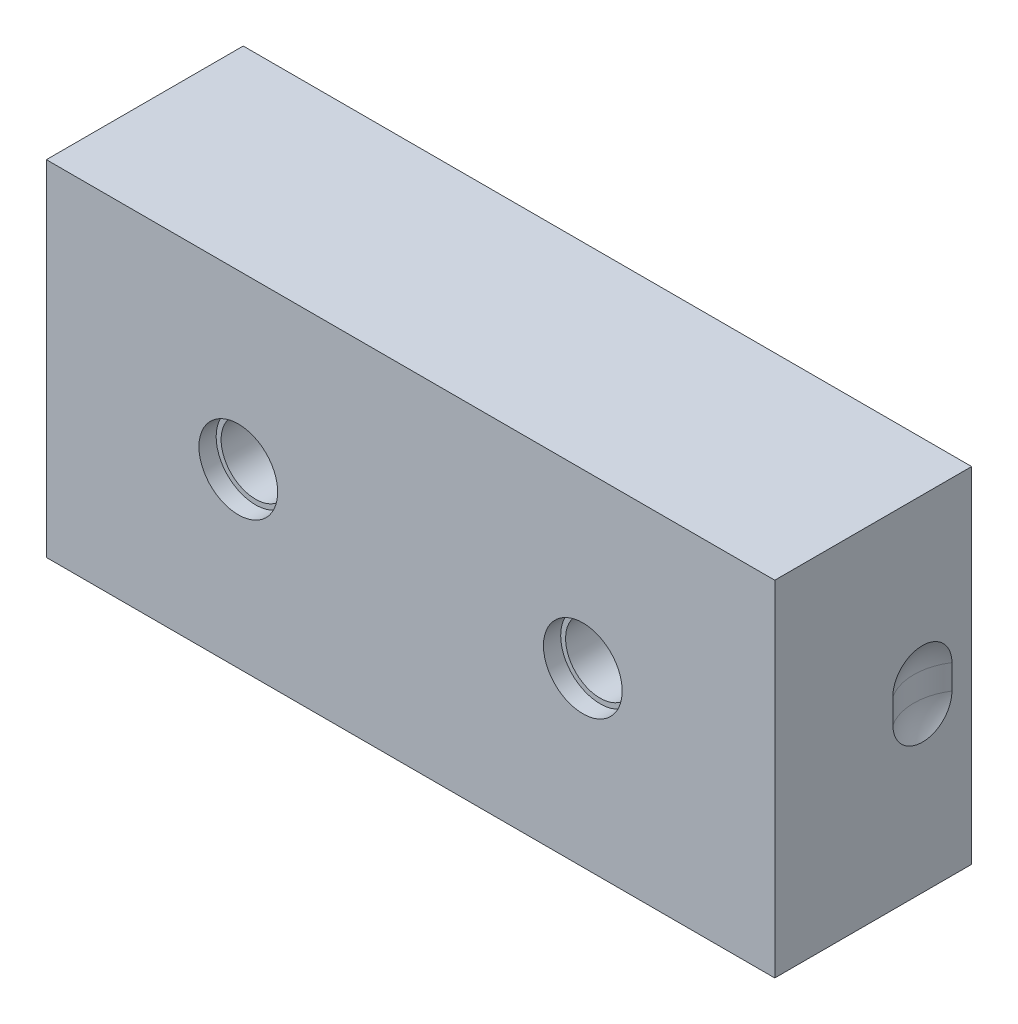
ISO-10303-21;
HEADER;
FILE_DESCRIPTION(('STEP AP214'),'2;1');
FILE_NAME('part.step','',(''),(''),'','','');
FILE_SCHEMA(('AUTOMOTIVE_DESIGN { 1 0 10303 214 1 1 1 1 }'));
ENDSEC;
DATA;
#1=APPLICATION_CONTEXT('core data for automotive mechanical design processes');
#2=APPLICATION_PROTOCOL_DEFINITION('international standard','automotive_design',2000,#1);
#3=PRODUCT_CONTEXT('',#1,'mechanical');
#4=PRODUCT('Part','Part','',(#3));
#5=PRODUCT_RELATED_PRODUCT_CATEGORY('part','',(#4));
#6=PRODUCT_DEFINITION_FORMATION('','',#4);
#7=PRODUCT_DEFINITION_CONTEXT('part definition',#1,'design');
#8=PRODUCT_DEFINITION('design','',#6,#7);
#9=PRODUCT_DEFINITION_SHAPE('','',#8);
#10=(LENGTH_UNIT() NAMED_UNIT(*) SI_UNIT(.MILLI.,.METRE.));
#11=(NAMED_UNIT(*) PLANE_ANGLE_UNIT() SI_UNIT($,.RADIAN.));
#12=(NAMED_UNIT(*) SI_UNIT($,.STERADIAN.) SOLID_ANGLE_UNIT());
#13=UNCERTAINTY_MEASURE_WITH_UNIT(LENGTH_MEASURE(1.E-05),#10,'distance_accuracy_value','');
#14=(GEOMETRIC_REPRESENTATION_CONTEXT(3) GLOBAL_UNCERTAINTY_ASSIGNED_CONTEXT((#13)) GLOBAL_UNIT_ASSIGNED_CONTEXT((#10,
#11,#12)) REPRESENTATION_CONTEXT('',''));
#15=CARTESIAN_POINT('',(0.,0.,0.));
#16=DIRECTION('',(0.,0.,1.));
#17=DIRECTION('',(1.,0.,0.));
#18=AXIS2_PLACEMENT_3D('',#15,#16,#17);
#19=CARTESIAN_POINT('',(-919.045422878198,315.473192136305,8.00000000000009));
#20=DIRECTION('',(0.,0.,-1.));
#21=DIRECTION('',(-1.,0.,0.));
#22=AXIS2_PLACEMENT_3D('',#19,#20,#21);
#23=PLANE('',#22);
#24=CARTESIAN_POINT('',(-919.045422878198,315.473192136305,8.0000000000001));
#25=DIRECTION('',(0.,0.,1.));
#26=DIRECTION('',(1.,0.,0.));
#27=AXIS2_PLACEMENT_3D('',#24,#25,#26);
#28=CIRCLE('',#27,7.);
#29=CARTESIAN_POINT('',(-912.045422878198,315.473192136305,8.0000000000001));
#30=VERTEX_POINT('',#29);
#31=EDGE_CURVE('E279',#30,#30,#28,.T.);
#32=ORIENTED_EDGE('',*,*,#31,.T.);
#33=EDGE_LOOP('',(#32));
#34=FACE_BOUND('',#33,.T.);
#35=CARTESIAN_POINT('',(-919.045422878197,315.473192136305,7.99999999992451));
#36=DIRECTION('',(0.,0.,1.));
#37=DIRECTION('',(1.,0.,0.));
#38=AXIS2_PLACEMENT_3D('',#35,#36,#37);
#39=CIRCLE('',#38,4.99999999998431);
#40=CARTESIAN_POINT('',(-914.045422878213,315.473192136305,7.99999999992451));
#41=VERTEX_POINT('',#40);
#42=EDGE_CURVE('E18',#41,#41,#39,.F.);
#43=ORIENTED_EDGE('',*,*,#42,.T.);
#44=EDGE_LOOP('',(#43));
#45=FACE_BOUND('',#44,.T.);
#46=ADVANCED_FACE('F14',(#34,#45),#23,.F.);
#47=CARTESIAN_POINT('',(-849.045422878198,315.473192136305,8.));
#48=DIRECTION('',(0.,0.,-1.));
#49=DIRECTION('',(-1.,0.,0.));
#50=AXIS2_PLACEMENT_3D('',#47,#48,#49);
#51=PLANE('',#50);
#52=CARTESIAN_POINT('',(-849.045422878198,315.473192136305,8.));
#53=DIRECTION('',(0.,0.,1.));
#54=DIRECTION('',(1.,0.,0.));
#55=AXIS2_PLACEMENT_3D('',#52,#53,#54);
#56=CIRCLE('',#55,7.);
#57=CARTESIAN_POINT('',(-842.045422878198,315.473192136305,8.));
#58=VERTEX_POINT('',#57);
#59=EDGE_CURVE('E275',#58,#58,#56,.T.);
#60=ORIENTED_EDGE('',*,*,#59,.T.);
#61=EDGE_LOOP('',(#60));
#62=FACE_BOUND('',#61,.T.);
#63=CARTESIAN_POINT('',(-849.045422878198,315.473192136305,7.99999999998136));
#64=DIRECTION('',(0.,0.,1.));
#65=DIRECTION('',(1.,0.,0.));
#66=AXIS2_PLACEMENT_3D('',#63,#64,#65);
#67=CIRCLE('',#66,4.99999999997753);
#68=CARTESIAN_POINT('',(-844.04542287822,315.473192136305,7.99999999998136));
#69=VERTEX_POINT('',#68);
#70=EDGE_CURVE('E281',#69,#69,#67,.F.);
#71=ORIENTED_EDGE('',*,*,#70,.T.);
#72=EDGE_LOOP('',(#71));
#73=FACE_BOUND('',#72,.T.);
#74=ADVANCED_FACE('F292',(#62,#73),#51,.F.);
#75=CARTESIAN_POINT('',(-919.045422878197,315.473192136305,7.99999999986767));
#76=DIRECTION('',(0.,0.,1.));
#77=DIRECTION('',(1.,0.,0.));
#78=AXIS2_PLACEMENT_3D('',#75,#76,#77);
#79=CONICAL_SURFACE('',#78,4.99999999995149,0.523598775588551);
#80=CARTESIAN_POINT('',(-919.045422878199,315.473192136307,6.61435935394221));
#81=DIRECTION('',(6.56531207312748E-13,-5.27037872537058E-13,-1.));
#82=DIRECTION('',(-1.,0.,-6.56531207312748E-13));
#83=AXIS2_PLACEMENT_3D('',#80,#81,#82);
#84=CIRCLE('',#83,4.2);
#85=CARTESIAN_POINT('',(-923.245422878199,315.473192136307,6.61435935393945));
#86=VERTEX_POINT('',#85);
#87=EDGE_CURVE('E278',#86,#86,#84,.T.);
#88=ORIENTED_EDGE('',*,*,#87,.T.);
#89=EDGE_LOOP('',(#88));
#90=FACE_BOUND('',#89,.T.);
#91=ORIENTED_EDGE('',*,*,#42,.F.);
#92=EDGE_LOOP('',(#91));
#93=FACE_BOUND('',#92,.T.);
#94=ADVANCED_FACE('F289',(#90,#93),#79,.F.);
#95=CARTESIAN_POINT('',(-849.045422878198,315.473192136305,7.99999999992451));
#96=DIRECTION('',(0.,0.,1.));
#97=DIRECTION('',(1.,0.,0.));
#98=AXIS2_PLACEMENT_3D('',#95,#96,#97);
#99=CONICAL_SURFACE('',#98,4.99999999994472,0.523598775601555);
#100=ORIENTED_EDGE('',*,*,#70,.F.);
#101=EDGE_LOOP('',(#100));
#102=FACE_BOUND('',#101,.T.);
#103=CARTESIAN_POINT('',(-849.045422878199,315.473192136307,6.61435935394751));
#104=DIRECTION('',(6.07971206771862E-13,-4.81229605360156E-13,-1.));
#105=DIRECTION('',(-1.,0.,-6.07971206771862E-13));
#106=AXIS2_PLACEMENT_3D('',#103,#104,#105);
#107=CIRCLE('',#106,4.2);
#108=CARTESIAN_POINT('',(-853.245422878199,315.473192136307,6.61435935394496));
#109=VERTEX_POINT('',#108);
#110=EDGE_CURVE('E274',#109,#109,#107,.T.);
#111=ORIENTED_EDGE('',*,*,#110,.T.);
#112=EDGE_LOOP('',(#111));
#113=FACE_BOUND('',#112,.T.);
#114=ADVANCED_FACE('F291',(#102,#113),#99,.F.);
#115=CARTESIAN_POINT('',(-919.045422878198,315.473192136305,24.));
#116=DIRECTION('',(0.,0.,1.));
#117=DIRECTION('',(1.,0.,0.));
#118=AXIS2_PLACEMENT_3D('',#115,#116,#117);
#119=CYLINDRICAL_SURFACE('',#118,7.);
#120=ORIENTED_EDGE('',*,*,#31,.F.);
#121=EDGE_LOOP('',(#120));
#122=FACE_BOUND('',#121,.T.);
#123=CARTESIAN_POINT('',(-919.045422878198,315.473192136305,36.5));
#124=DIRECTION('',(0.,0.,1.));
#125=DIRECTION('',(1.,0.,0.));
#126=AXIS2_PLACEMENT_3D('',#123,#124,#125);
#127=CIRCLE('',#126,7.);
#128=CARTESIAN_POINT('',(-912.045422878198,315.473192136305,36.5));
#129=VERTEX_POINT('',#128);
#130=EDGE_CURVE('E271',#129,#129,#127,.T.);
#131=ORIENTED_EDGE('',*,*,#130,.T.);
#132=EDGE_LOOP('',(#131));
#133=FACE_BOUND('',#132,.T.);
#134=ADVANCED_FACE('F301',(#122,#133),#119,.F.);
#135=CARTESIAN_POINT('',(-849.045422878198,315.473192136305,24.));
#136=DIRECTION('',(0.,0.,1.));
#137=DIRECTION('',(1.,0.,0.));
#138=AXIS2_PLACEMENT_3D('',#135,#136,#137);
#139=CYLINDRICAL_SURFACE('',#138,7.);
#140=ORIENTED_EDGE('',*,*,#59,.F.);
#141=EDGE_LOOP('',(#140));
#142=FACE_BOUND('',#141,.T.);
#143=CARTESIAN_POINT('',(-849.045422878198,315.473192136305,36.5));
#144=DIRECTION('',(0.,0.,1.));
#145=DIRECTION('',(1.,0.,0.));
#146=AXIS2_PLACEMENT_3D('',#143,#144,#145);
#147=CIRCLE('',#146,7.);
#148=CARTESIAN_POINT('',(-842.045422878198,315.473192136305,36.5));
#149=VERTEX_POINT('',#148);
#150=EDGE_CURVE('E268',#149,#149,#147,.T.);
#151=ORIENTED_EDGE('',*,*,#150,.T.);
#152=EDGE_LOOP('',(#151));
#153=FACE_BOUND('',#152,.T.);
#154=ADVANCED_FACE('F1128',(#142,#153),#139,.F.);
#155=CARTESIAN_POINT('',(-919.045422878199,315.473192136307,6.61435935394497));
#156=DIRECTION('',(6.56531207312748E-13,-5.27037872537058E-13,-1.));
#157=DIRECTION('',(-1.,0.,-6.56531207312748E-13));
#158=AXIS2_PLACEMENT_3D('',#155,#156,#157);
#159=CYLINDRICAL_SURFACE('',#158,4.2);
#160=CARTESIAN_POINT('',(-919.045422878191,315.473192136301,-4.99999999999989));
#161=DIRECTION('',(6.56531207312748E-13,-5.27037872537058E-13,-1.));
#162=DIRECTION('',(-1.,0.,-6.56531207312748E-13));
#163=AXIS2_PLACEMENT_3D('',#160,#161,#162);
#164=CIRCLE('',#163,4.2);
#165=CARTESIAN_POINT('',(-923.245422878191,315.473192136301,-5.00000000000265));
#166=VERTEX_POINT('',#165);
#167=EDGE_CURVE('E265',#166,#166,#164,.T.);
#168=ORIENTED_EDGE('',*,*,#167,.T.);
#169=EDGE_LOOP('',(#168));
#170=FACE_BOUND('',#169,.T.);
#171=ORIENTED_EDGE('',*,*,#87,.F.);
#172=EDGE_LOOP('',(#171));
#173=FACE_BOUND('',#172,.T.);
#174=ADVANCED_FACE('F1106',(#170,#173),#159,.F.);
#175=CARTESIAN_POINT('',(-849.045422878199,315.473192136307,6.61435935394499));
#176=DIRECTION('',(6.07971206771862E-13,-4.81229605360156E-13,-1.));
#177=DIRECTION('',(-1.,0.,-6.07971206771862E-13));
#178=AXIS2_PLACEMENT_3D('',#175,#176,#177);
#179=CYLINDRICAL_SURFACE('',#178,4.2);
#180=ORIENTED_EDGE('',*,*,#110,.F.);
#181=EDGE_LOOP('',(#180));
#182=FACE_BOUND('',#181,.T.);
#183=CARTESIAN_POINT('',(-849.045422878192,315.473192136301,-5.00000000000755));
#184=DIRECTION('',(6.07971206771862E-13,-4.81229605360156E-13,-1.));
#185=DIRECTION('',(-1.,0.,-6.07971206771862E-13));
#186=AXIS2_PLACEMENT_3D('',#183,#184,#185);
#187=CIRCLE('',#186,4.2);
#188=CARTESIAN_POINT('',(-853.245422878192,315.473192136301,-5.0000000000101));
#189=VERTEX_POINT('',#188);
#190=EDGE_CURVE('E262',#189,#189,#187,.F.);
#191=ORIENTED_EDGE('',*,*,#190,.F.);
#192=EDGE_LOOP('',(#191));
#193=FACE_BOUND('',#192,.T.);
#194=ADVANCED_FACE('F1100',(#182,#193),#179,.F.);
#195=CARTESIAN_POINT('',(-919.045422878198,315.473192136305,36.5));
#196=DIRECTION('',(0.,0.,-1.));
#197=DIRECTION('',(-1.,0.,0.));
#198=AXIS2_PLACEMENT_3D('',#195,#196,#197);
#199=PLANE('',#198);
#200=CARTESIAN_POINT('',(-919.045422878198,315.473192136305,36.5));
#201=DIRECTION('',(0.,0.,-1.));
#202=DIRECTION('',(-1.,0.,0.));
#203=AXIS2_PLACEMENT_3D('',#200,#201,#202);
#204=CIRCLE('',#203,8.);
#205=CARTESIAN_POINT('',(-927.045422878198,315.473192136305,36.5));
#206=VERTEX_POINT('',#205);
#207=EDGE_CURVE('E259',#206,#206,#204,.F.);
#208=ORIENTED_EDGE('',*,*,#207,.T.);
#209=EDGE_LOOP('',(#208));
#210=FACE_BOUND('',#209,.T.);
#211=ORIENTED_EDGE('',*,*,#130,.F.);
#212=EDGE_LOOP('',(#211));
#213=FACE_BOUND('',#212,.T.);
#214=ADVANCED_FACE('F1105',(#210,#213),#199,.F.);
#215=CARTESIAN_POINT('',(-849.045422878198,315.473192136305,36.5));
#216=DIRECTION('',(0.,0.,-1.));
#217=DIRECTION('',(-1.,0.,0.));
#218=AXIS2_PLACEMENT_3D('',#215,#216,#217);
#219=PLANE('',#218);
#220=CARTESIAN_POINT('',(-849.045422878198,315.473192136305,36.5));
#221=DIRECTION('',(0.,0.,-1.));
#222=DIRECTION('',(-1.,0.,0.));
#223=AXIS2_PLACEMENT_3D('',#220,#221,#222);
#224=CIRCLE('',#223,8.);
#225=CARTESIAN_POINT('',(-857.045422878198,315.473192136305,36.5));
#226=VERTEX_POINT('',#225);
#227=EDGE_CURVE('E217',#226,#226,#224,.F.);
#228=ORIENTED_EDGE('',*,*,#227,.T.);
#229=EDGE_LOOP('',(#228));
#230=FACE_BOUND('',#229,.T.);
#231=ORIENTED_EDGE('',*,*,#150,.F.);
#232=EDGE_LOOP('',(#231));
#233=FACE_BOUND('',#232,.T.);
#234=ADVANCED_FACE('F1118',(#230,#233),#219,.F.);
#235=CARTESIAN_POINT('',(-919.04542287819,315.4731921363,-4.99999999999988));
#236=DIRECTION('',(0.,0.,1.));
#237=DIRECTION('',(0.,-1.,0.));
#238=AXIS2_PLACEMENT_3D('',#235,#236,#237);
#239=PLANE('',#238);
#240=DIRECTION('',(0.707106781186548,0.707106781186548,0.));
#241=VECTOR('',#240,1.);
#242=CARTESIAN_POINT('',(-917.183013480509,309.769558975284,-4.99999999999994));
#243=LINE('',#242,#241);
#244=CARTESIAN_POINT('',(-917.183013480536,309.769558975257,-5.00000000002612));
#245=VERTEX_POINT('',#244);
#246=CARTESIAN_POINT('',(-913.341789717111,313.61078273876,-5.00000000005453));
#247=VERTEX_POINT('',#246);
#248=EDGE_CURVE('E208',#245,#247,#243,.T.);
#249=ORIENTED_EDGE('',*,*,#248,.F.);
#250=CARTESIAN_POINT('',(-919.04542287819,315.4731921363,-5.00000000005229));
#251=DIRECTION('',(0.,0.,1.));
#252=DIRECTION('',(1.,0.,0.));
#253=AXIS2_PLACEMENT_3D('',#250,#251,#252);
#254=CIRCLE('',#253,6.00000000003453);
#255=CARTESIAN_POINT('',(-920.90783227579,309.769558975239,-5.00000000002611));
#256=VERTEX_POINT('',#255);
#257=EDGE_CURVE('E254',#256,#245,#254,.T.);
#258=ORIENTED_EDGE('',*,*,#257,.F.);
#259=DIRECTION('',(0.707106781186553,-0.707106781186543,0.));
#260=VECTOR('',#259,1.);
#261=CARTESIAN_POINT('',(-924.749056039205,313.610782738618,-4.9999999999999));
#262=LINE('',#261,#260);
#263=CARTESIAN_POINT('',(-924.749056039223,313.610782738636,-5.0000000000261));
#264=VERTEX_POINT('',#263);
#265=EDGE_CURVE('E733',#264,#256,#262,.T.);
#266=ORIENTED_EDGE('',*,*,#265,.F.);
#267=CARTESIAN_POINT('',(-919.04542287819,315.4731921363,-5.00000000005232));
#268=DIRECTION('',(0.,0.,1.));
#269=DIRECTION('',(1.,0.,0.));
#270=AXIS2_PLACEMENT_3D('',#267,#268,#269);
#271=CIRCLE('',#270,6.00000000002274);
#272=CARTESIAN_POINT('',(-924.749056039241,317.335601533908,-5.00000000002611));
#273=VERTEX_POINT('',#272);
#274=EDGE_CURVE('E716',#273,#264,#271,.T.);
#275=ORIENTED_EDGE('',*,*,#274,.F.);
#276=DIRECTION('',(-0.707106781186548,-0.707106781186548,0.));
#277=VECTOR('',#276,1.);
#278=CARTESIAN_POINT('',(-920.907832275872,321.176825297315,-4.9999999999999));
#279=LINE('',#278,#277);
#280=CARTESIAN_POINT('',(-920.907832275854,321.176825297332,-4.99999999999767));
#281=VERTEX_POINT('',#280);
#282=EDGE_CURVE('E732',#281,#273,#279,.T.);
#283=ORIENTED_EDGE('',*,*,#282,.F.);
#284=CARTESIAN_POINT('',(-919.04542287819,315.4731921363,-4.99999999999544));
#285=DIRECTION('',(0.,0.,1.));
#286=DIRECTION('',(1.,0.,0.));
#287=AXIS2_PLACEMENT_3D('',#284,#285,#286);
#288=CIRCLE('',#287,6.00000000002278);
#289=CARTESIAN_POINT('',(-917.183013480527,321.176825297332,-4.99999999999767));
#290=VERTEX_POINT('',#289);
#291=EDGE_CURVE('E703',#290,#281,#288,.T.);
#292=ORIENTED_EDGE('',*,*,#291,.F.);
#293=DIRECTION('',(-0.707106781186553,0.707106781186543,0.));
#294=VECTOR('',#293,1.);
#295=CARTESIAN_POINT('',(-913.341789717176,317.335601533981,-4.99999999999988));
#296=LINE('',#295,#294);
#297=CARTESIAN_POINT('',(-913.341789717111,317.335601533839,-5.00000000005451));
#298=VERTEX_POINT('',#297);
#299=EDGE_CURVE('E211',#298,#290,#296,.T.);
#300=ORIENTED_EDGE('',*,*,#299,.F.);
#301=CARTESIAN_POINT('',(-919.04542287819,315.4731921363,-5.00000000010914));
#302=DIRECTION('',(0.,0.,1.));
#303=DIRECTION('',(1.,0.,0.));
#304=AXIS2_PLACEMENT_3D('',#301,#302,#303);
#305=CIRCLE('',#304,6.00000000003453);
#306=EDGE_CURVE('E203',#247,#298,#305,.T.);
#307=ORIENTED_EDGE('',*,*,#306,.F.);
#308=EDGE_LOOP('',(#249,#258,#266,#275,#283,#292,#300,#307));
#309=FACE_BOUND('',#308,.T.);
#310=ORIENTED_EDGE('',*,*,#167,.F.);
#311=EDGE_LOOP('',(#310));
#312=FACE_BOUND('',#311,.T.);
#313=ADVANCED_FACE('F205',(#309,#312),#239,.F.);
#314=CARTESIAN_POINT('',(-842.945422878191,312.59293601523,-4.9999999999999));
#315=DIRECTION('',(0.,0.,-1.));
#316=DIRECTION('',(-1.,0.,0.));
#317=AXIS2_PLACEMENT_3D('',#314,#315,#316);
#318=PLANE('',#317);
#319=DIRECTION('',(0.,1.,0.));
#320=VECTOR('',#319,1.);
#321=CARTESIAN_POINT('',(-854.14542287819,315.4731921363,-4.99999999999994));
#322=LINE('',#321,#320);
#323=CARTESIAN_POINT('',(-854.14542287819,317.939234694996,-5.));
#324=VERTEX_POINT('',#323);
#325=CARTESIAN_POINT('',(-854.14542287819,313.007149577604,-4.99999999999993));
#326=VERTEX_POINT('',#325);
#327=EDGE_CURVE('E440',#324,#326,#322,.F.);
#328=ORIENTED_EDGE('',*,*,#327,.F.);
#329=DIRECTION('',(-0.707106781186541,-0.707106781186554,0.));
#330=VECTOR('',#329,1.);
#331=CARTESIAN_POINT('',(-850.907832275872,321.176825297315,-4.99999999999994));
#332=LINE('',#331,#330);
#333=CARTESIAN_POINT('',(-850.907832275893,321.176825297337,-4.99999999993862));
#334=VERTEX_POINT('',#333);
#335=EDGE_CURVE('E430',#334,#324,#332,.T.);
#336=ORIENTED_EDGE('',*,*,#335,.F.);
#337=CARTESIAN_POINT('',(-849.045422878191,315.4731921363,-4.99999999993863));
#338=DIRECTION('',(0.,0.,1.));
#339=DIRECTION('',(1.,0.,0.));
#340=AXIS2_PLACEMENT_3D('',#337,#338,#339);
#341=CIRCLE('',#340,6.00000000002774);
#342=CARTESIAN_POINT('',(-850.907832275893,309.769558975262,-4.99999999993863));
#343=VERTEX_POINT('',#342);
#344=EDGE_CURVE('E699',#343,#334,#341,.T.);
#345=ORIENTED_EDGE('',*,*,#344,.F.);
#346=DIRECTION('',(0.707106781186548,-0.707106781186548,0.));
#347=VECTOR('',#346,1.);
#348=CARTESIAN_POINT('',(-854.14542287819,313.007149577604,-4.99999999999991));
#349=LINE('',#348,#347);
#350=EDGE_CURVE('E460',#326,#343,#349,.T.);
#351=ORIENTED_EDGE('',*,*,#350,.F.);
#352=EDGE_LOOP('',(#328,#336,#345,#351));
#353=FACE_BOUND('',#352,.T.);
#354=ORIENTED_EDGE('',*,*,#190,.T.);
#355=EDGE_LOOP('',(#354));
#356=FACE_BOUND('',#355,.T.);
#357=ADVANCED_FACE('F1085',(#353,#356),#318,.T.);
#358=CARTESIAN_POINT('',(-919.045422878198,315.473192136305,23.25));
#359=DIRECTION('',(0.,0.,-1.));
#360=DIRECTION('',(-1.,0.,0.));
#361=AXIS2_PLACEMENT_3D('',#358,#359,#360);
#362=CYLINDRICAL_SURFACE('',#361,8.);
#363=ORIENTED_EDGE('',*,*,#207,.F.);
#364=EDGE_LOOP('',(#363));
#365=FACE_BOUND('',#364,.T.);
#366=CARTESIAN_POINT('',(-919.045422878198,315.473192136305,40.));
#367=DIRECTION('',(0.,0.,-1.));
#368=DIRECTION('',(-1.,0.,0.));
#369=AXIS2_PLACEMENT_3D('',#366,#367,#368);
#370=CIRCLE('',#369,8.);
#371=CARTESIAN_POINT('',(-927.045422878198,315.473192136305,40.));
#372=VERTEX_POINT('',#371);
#373=EDGE_CURVE('E1198',#372,#372,#370,.T.);
#374=ORIENTED_EDGE('',*,*,#373,.F.);
#375=EDGE_LOOP('',(#374));
#376=FACE_BOUND('',#375,.T.);
#377=ADVANCED_FACE('F1090',(#365,#376),#362,.F.);
#378=CARTESIAN_POINT('',(-849.045422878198,315.473192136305,23.25));
#379=DIRECTION('',(0.,0.,-1.));
#380=DIRECTION('',(-1.,0.,0.));
#381=AXIS2_PLACEMENT_3D('',#378,#379,#380);
#382=CYLINDRICAL_SURFACE('',#381,8.);
#383=ORIENTED_EDGE('',*,*,#227,.F.);
#384=EDGE_LOOP('',(#383));
#385=FACE_BOUND('',#384,.T.);
#386=CARTESIAN_POINT('',(-849.045422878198,315.473192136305,40.));
#387=DIRECTION('',(0.,0.,-1.));
#388=DIRECTION('',(-1.,0.,0.));
#389=AXIS2_PLACEMENT_3D('',#386,#387,#388);
#390=CIRCLE('',#389,8.);
#391=CARTESIAN_POINT('',(-857.045422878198,315.473192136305,40.));
#392=VERTEX_POINT('',#391);
#393=EDGE_CURVE('E446',#392,#392,#390,.T.);
#394=ORIENTED_EDGE('',*,*,#393,.F.);
#395=EDGE_LOOP('',(#394));
#396=FACE_BOUND('',#395,.T.);
#397=ADVANCED_FACE('F1151',(#385,#396),#382,.F.);
#398=CARTESIAN_POINT('',(-919.04542287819,315.4731921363,-4.00000000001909));
#399=DIRECTION('',(0.,0.,1.));
#400=DIRECTION('',(1.,0.,0.));
#401=AXIS2_PLACEMENT_3D('',#398,#399,#400);
#402=CONICAL_SURFACE('',#401,7.00000000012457,0.785398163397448);
#403=CARTESIAN_POINT('',(-913.341789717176,313.610782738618,-4.9999999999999));
#404=CARTESIAN_POINT('',(-912.921385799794,313.352733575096,-4.52026122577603));
#405=CARTESIAN_POINT('',(-912.472328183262,313.066030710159,-3.9999999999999));
#406=B_SPLINE_CURVE_WITH_KNOTS('',2,(#403,#404,#405),.UNSPECIFIED.,.F.,.F.,(3,3),(0.,1.),.UNSPECIFIED.);
#407=CARTESIAN_POINT('',(-912.472328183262,313.066030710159,-3.99999999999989));
#408=VERTEX_POINT('',#407);
#409=EDGE_CURVE('E216',#247,#408,#406,.T.);
#410=ORIENTED_EDGE('',*,*,#409,.F.);
#411=ORIENTED_EDGE('',*,*,#306,.T.);
#412=CARTESIAN_POINT('',(-912.472328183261,317.88035356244,-3.99999999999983));
#413=CARTESIAN_POINT('',(-912.921385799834,317.593650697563,-4.5202612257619));
#414=CARTESIAN_POINT('',(-913.341789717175,317.335601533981,-4.99999999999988));
#415=B_SPLINE_CURVE_WITH_KNOTS('',2,(#412,#413,#414),.UNSPECIFIED.,.F.,.F.,(3,3),(0.,1.),.UNSPECIFIED.);
#416=CARTESIAN_POINT('',(-912.472328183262,317.88035356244,-3.99999999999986));
#417=VERTEX_POINT('',#416);
#418=EDGE_CURVE('E706',#417,#298,#415,.T.);
#419=ORIENTED_EDGE('',*,*,#418,.F.);
#420=CARTESIAN_POINT('',(-919.04542287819,315.4731921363,-3.99999999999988));
#421=DIRECTION('',(0.,0.,1.));
#422=DIRECTION('',(1.,0.,0.));
#423=AXIS2_PLACEMENT_3D('',#420,#421,#422);
#424=CIRCLE('',#423,7.);
#425=EDGE_CURVE('E228',#408,#417,#424,.T.);
#426=ORIENTED_EDGE('',*,*,#425,.F.);
#427=EDGE_LOOP('',(#410,#411,#419,#426));
#428=FACE_BOUND('',#427,.T.);
#429=ADVANCED_FACE('F227',(#428),#402,.T.);
#430=CARTESIAN_POINT('',(-913.867364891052,312.378100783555,-4.49999999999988));
#431=DIRECTION('',(0.5,-0.5,-0.707106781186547));
#432=DIRECTION('',(-0.816496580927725,0.,-0.577350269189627));
#433=AXIS2_PLACEMENT_3D('',#430,#431,#432);
#434=PLANE('',#433);
#435=CARTESIAN_POINT('',(-917.183013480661,309.769558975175,-5.00000000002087));
#436=CARTESIAN_POINT('',(-917.093412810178,309.623702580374,-4.83350671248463));
#437=CARTESIAN_POINT('',(-917.003216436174,309.478319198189,-4.66692666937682));
#438=CARTESIAN_POINT('',(-916.821632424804,309.188498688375,-4.33359333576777));
#439=CARTESIAN_POINT('',(-916.730244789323,309.044061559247,-4.1668400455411));
#440=CARTESIAN_POINT('',(-916.638261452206,308.90009744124,-4.00000000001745));
#441=B_SPLINE_CURVE_WITH_KNOTS('',3,(#435,#436,#437,#438,#439,#440),.UNSPECIFIED.,.F.,.F.,(4,2,
4),(0.,0.71636975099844,1.4327383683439),.UNSPECIFIED.);
#442=CARTESIAN_POINT('',(-916.638261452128,308.900097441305,-4.00000000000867));
#443=VERTEX_POINT('',#442);
#444=EDGE_CURVE('E224',#245,#443,#441,.T.);
#445=ORIENTED_EDGE('',*,*,#444,.F.);
#446=ORIENTED_EDGE('',*,*,#248,.T.);
#447=ORIENTED_EDGE('',*,*,#409,.T.);
#448=DIRECTION('',(0.707106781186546,0.70710678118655,0.));
#449=VECTOR('',#448,1.);
#450=CARTESIAN_POINT('',(-912.472328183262,313.066030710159,-3.99999999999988));
#451=LINE('',#450,#449);
#452=EDGE_CURVE('E416',#443,#408,#451,.T.);
#453=ORIENTED_EDGE('',*,*,#452,.F.);
#454=EDGE_LOOP('',(#445,#446,#447,#453));
#455=FACE_BOUND('',#454,.T.);
#456=ADVANCED_FACE('F221',(#455),#434,.T.);
#457=CARTESIAN_POINT('',(-919.04542287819,315.4731921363,-4.00000000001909));
#458=DIRECTION('',(0.,0.,1.));
#459=DIRECTION('',(1.,0.,0.));
#460=AXIS2_PLACEMENT_3D('',#457,#458,#459);
#461=CONICAL_SURFACE('',#460,7.00000000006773,0.785398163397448);
#462=CARTESIAN_POINT('',(-920.907832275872,309.769558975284,-4.99999999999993));
#463=CARTESIAN_POINT('',(-921.165881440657,309.349155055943,-4.52026122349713));
#464=CARTESIAN_POINT('',(-921.452584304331,308.900097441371,-3.99999999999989));
#465=B_SPLINE_CURVE_WITH_KNOTS('',2,(#462,#463,#464),.UNSPECIFIED.,.F.,.F.,(3,3),(0.,1.),.UNSPECIFIED.);
#466=CARTESIAN_POINT('',(-921.452584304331,308.90009744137,-3.99999999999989));
#467=VERTEX_POINT('',#466);
#468=EDGE_CURVE('E1258',#256,#467,#465,.T.);
#469=ORIENTED_EDGE('',*,*,#468,.F.);
#470=ORIENTED_EDGE('',*,*,#257,.T.);
#471=ORIENTED_EDGE('',*,*,#444,.T.);
#472=CARTESIAN_POINT('',(-919.04542287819,315.4731921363,-3.99999999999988));
#473=DIRECTION('',(0.,0.,1.));
#474=DIRECTION('',(1.,0.,0.));
#475=AXIS2_PLACEMENT_3D('',#472,#473,#474);
#476=CIRCLE('',#475,7.);
#477=EDGE_CURVE('E413',#467,#443,#476,.T.);
#478=ORIENTED_EDGE('',*,*,#477,.F.);
#479=EDGE_LOOP('',(#469,#470,#471,#478));
#480=FACE_BOUND('',#479,.T.);
#481=ADVANCED_FACE('F243',(#480),#461,.T.);
#482=CARTESIAN_POINT('',(-922.140514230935,310.295134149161,-4.49999999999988));
#483=DIRECTION('',(-0.5,-0.5,-0.707106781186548));
#484=DIRECTION('',(-0.816496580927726,0.,0.577350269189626));
#485=AXIS2_PLACEMENT_3D('',#482,#483,#484);
#486=PLANE('',#485);
#487=ORIENTED_EDGE('',*,*,#468,.T.);
#488=DIRECTION('',(0.707106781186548,-0.707106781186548,0.));
#489=VECTOR('',#488,1.);
#490=CARTESIAN_POINT('',(-921.452584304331,308.90009744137,-3.99999999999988));
#491=LINE('',#490,#489);
#492=CARTESIAN_POINT('',(-925.618517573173,313.066030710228,-4.00000000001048));
#493=VERTEX_POINT('',#492);
#494=EDGE_CURVE('E410',#493,#467,#491,.T.);
#495=ORIENTED_EDGE('',*,*,#494,.F.);
#496=CARTESIAN_POINT('',(-924.749056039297,313.610782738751,-5.00000000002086));
#497=CARTESIAN_POINT('',(-924.894912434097,313.521182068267,-4.83350671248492));
#498=CARTESIAN_POINT('',(-925.04029581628,313.430985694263,-4.66692666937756));
#499=CARTESIAN_POINT('',(-925.330116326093,313.249401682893,-4.33359333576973));
#500=CARTESIAN_POINT('',(-925.47455345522,313.158014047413,-4.16684004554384));
#501=CARTESIAN_POINT('',(-925.618517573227,313.066030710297,-4.00000000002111));
#502=B_SPLINE_CURVE_WITH_KNOTS('',3,(#496,#497,#498,#499,#500,#501),.UNSPECIFIED.,.F.,.F.,(4,2,
4),(0.,0.716369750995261,1.4327383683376),.UNSPECIFIED.);
#503=EDGE_CURVE('E1248',#264,#493,#502,.T.);
#504=ORIENTED_EDGE('',*,*,#503,.F.);
#505=ORIENTED_EDGE('',*,*,#265,.T.);
#506=EDGE_LOOP('',(#487,#495,#504,#505));
#507=FACE_BOUND('',#506,.T.);
#508=ADVANCED_FACE('F863',(#507),#486,.T.);
#509=CARTESIAN_POINT('',(-919.04542287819,315.4731921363,-4.00000000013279));
#510=DIRECTION('',(0.,0.,1.));
#511=DIRECTION('',(1.,0.,0.));
#512=AXIS2_PLACEMENT_3D('',#509,#510,#511);
#513=CONICAL_SURFACE('',#512,6.99999999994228,0.785398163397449);
#514=CARTESIAN_POINT('',(-924.749056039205,317.335601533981,-4.99999999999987));
#515=CARTESIAN_POINT('',(-925.169459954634,317.593650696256,-4.52026122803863));
#516=CARTESIAN_POINT('',(-925.618517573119,317.88035356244,-3.99999999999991));
#517=B_SPLINE_CURVE_WITH_KNOTS('',2,(#514,#515,#516),.UNSPECIFIED.,.F.,.F.,(3,3),(0.,1.),.UNSPECIFIED.);
#518=CARTESIAN_POINT('',(-925.618517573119,317.88035356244,-3.9999999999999));
#519=VERTEX_POINT('',#518);
#520=EDGE_CURVE('E715',#273,#519,#517,.T.);
#521=ORIENTED_EDGE('',*,*,#520,.F.);
#522=ORIENTED_EDGE('',*,*,#274,.T.);
#523=ORIENTED_EDGE('',*,*,#503,.T.);
#524=CARTESIAN_POINT('',(-919.04542287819,315.4731921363,-3.99999999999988));
#525=DIRECTION('',(0.,0.,1.));
#526=DIRECTION('',(1.,0.,0.));
#527=AXIS2_PLACEMENT_3D('',#524,#525,#526);
#528=CIRCLE('',#527,7.);
#529=EDGE_CURVE('E407',#519,#493,#528,.T.);
#530=ORIENTED_EDGE('',*,*,#529,.F.);
#531=EDGE_LOOP('',(#521,#522,#523,#530));
#532=FACE_BOUND('',#531,.T.);
#533=ADVANCED_FACE('F724',(#532),#513,.T.);
#534=CARTESIAN_POINT('',(-924.223480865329,318.568283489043,-4.49999999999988));
#535=DIRECTION('',(-0.5,0.5,-0.707106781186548));
#536=DIRECTION('',(-0.816496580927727,0.,0.577350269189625));
#537=AXIS2_PLACEMENT_3D('',#534,#535,#536);
#538=PLANE('',#537);
#539=ORIENTED_EDGE('',*,*,#520,.T.);
#540=DIRECTION('',(-0.707106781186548,-0.707106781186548,0.));
#541=VECTOR('',#540,1.);
#542=CARTESIAN_POINT('',(-925.618517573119,317.88035356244,-3.99999999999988));
#543=LINE('',#542,#541);
#544=CARTESIAN_POINT('',(-921.452584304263,322.046286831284,-4.00000000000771));
#545=VERTEX_POINT('',#544);
#546=EDGE_CURVE('E404',#545,#519,#543,.T.);
#547=ORIENTED_EDGE('',*,*,#546,.F.);
#548=CARTESIAN_POINT('',(-920.907832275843,321.176825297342,-4.99999999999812));
#549=CARTESIAN_POINT('',(-920.99743294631,321.322681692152,-4.83350671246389));
#550=CARTESIAN_POINT('',(-921.087629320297,321.468065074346,-4.66692666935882));
#551=CARTESIAN_POINT('',(-921.269213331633,321.757885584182,-4.33359333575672));
#552=CARTESIAN_POINT('',(-921.360600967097,321.902322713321,-4.16684004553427));
#553=CARTESIAN_POINT('',(-921.452584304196,322.046286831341,-4.00000000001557));
#554=B_SPLINE_CURVE_WITH_KNOTS('',3,(#548,#549,#550,#551,#552,#553),.UNSPECIFIED.,.F.,.F.,(4,2,
4),(0.,0.716369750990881,1.43273836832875),.UNSPECIFIED.);
#555=EDGE_CURVE('E707',#281,#545,#554,.T.);
#556=ORIENTED_EDGE('',*,*,#555,.F.);
#557=ORIENTED_EDGE('',*,*,#282,.T.);
#558=EDGE_LOOP('',(#539,#547,#556,#557));
#559=FACE_BOUND('',#558,.T.);
#560=ADVANCED_FACE('F720',(#559),#538,.T.);
#561=CARTESIAN_POINT('',(-919.04542287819,315.4731921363,-4.0000000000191));
#562=DIRECTION('',(0.,0.,1.));
#563=DIRECTION('',(1.,0.,0.));
#564=AXIS2_PLACEMENT_3D('',#561,#562,#563);
#565=CONICAL_SURFACE('',#564,7.00000000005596,0.785398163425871);
#566=CARTESIAN_POINT('',(-917.183013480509,321.176825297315,-4.9999999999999));
#567=CARTESIAN_POINT('',(-916.924964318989,321.597229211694,-4.52026122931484));
#568=CARTESIAN_POINT('',(-916.63826145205,322.046286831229,-3.99999999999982));
#569=B_SPLINE_CURVE_WITH_KNOTS('',2,(#566,#567,#568),.UNSPECIFIED.,.F.,.F.,(3,3),(0.,1.),.UNSPECIFIED.);
#570=CARTESIAN_POINT('',(-916.63826145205,322.046286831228,-3.99999999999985));
#571=VERTEX_POINT('',#570);
#572=EDGE_CURVE('E702',#290,#571,#569,.T.);
#573=ORIENTED_EDGE('',*,*,#572,.F.);
#574=ORIENTED_EDGE('',*,*,#291,.T.);
#575=ORIENTED_EDGE('',*,*,#555,.T.);
#576=CARTESIAN_POINT('',(-919.04542287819,315.4731921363,-3.99999999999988));
#577=DIRECTION('',(0.,0.,1.));
#578=DIRECTION('',(1.,0.,0.));
#579=AXIS2_PLACEMENT_3D('',#576,#577,#578);
#580=CIRCLE('',#579,7.);
#581=EDGE_CURVE('E402',#571,#545,#580,.T.);
#582=ORIENTED_EDGE('',*,*,#581,.F.);
#583=EDGE_LOOP('',(#573,#574,#575,#582));
#584=FACE_BOUND('',#583,.T.);
#585=ADVANCED_FACE('F717',(#584),#565,.T.);
#586=CARTESIAN_POINT('',(-915.950331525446,320.651250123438,-4.49999999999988));
#587=DIRECTION('',(0.5,0.5,-0.707106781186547));
#588=DIRECTION('',(0.,0.816496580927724,0.577350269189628));
#589=AXIS2_PLACEMENT_3D('',#586,#587,#588);
#590=PLANE('',#589);
#591=ORIENTED_EDGE('',*,*,#572,.T.);
#592=DIRECTION('',(-0.707106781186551,0.707106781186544,0.));
#593=VECTOR('',#592,1.);
#594=CARTESIAN_POINT('',(-916.63826145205,322.046286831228,-3.99999999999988));
#595=LINE('',#594,#593);
#596=EDGE_CURVE('E397',#417,#571,#595,.T.);
#597=ORIENTED_EDGE('',*,*,#596,.F.);
#598=ORIENTED_EDGE('',*,*,#418,.T.);
#599=ORIENTED_EDGE('',*,*,#299,.T.);
#600=EDGE_LOOP('',(#591,#597,#598,#599));
#601=FACE_BOUND('',#600,.T.);
#602=ADVANCED_FACE('F744',(#601),#590,.T.);
#603=CARTESIAN_POINT('',(-849.045422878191,315.4731921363,-4.00000000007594));
#604=DIRECTION('',(0.,0.,1.));
#605=DIRECTION('',(1.,0.,0.));
#606=AXIS2_PLACEMENT_3D('',#603,#604,#605);
#607=CONICAL_SURFACE('',#606,6.99999999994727,0.785398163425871);
#608=CARTESIAN_POINT('',(-850.907832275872,309.769558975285,-4.99999999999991));
#609=CARTESIAN_POINT('',(-851.165881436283,309.349155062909,-4.52026123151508));
#610=CARTESIAN_POINT('',(-851.452584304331,308.900097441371,-3.99999999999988));
#611=B_SPLINE_CURVE_WITH_KNOTS('',2,(#608,#609,#610),.UNSPECIFIED.,.F.,.F.,(3,3),(0.,1.),.UNSPECIFIED.);
#612=CARTESIAN_POINT('',(-851.452584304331,308.90009744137,-3.9999999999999));
#613=VERTEX_POINT('',#612);
#614=EDGE_CURVE('E701',#343,#613,#611,.T.);
#615=ORIENTED_EDGE('',*,*,#614,.F.);
#616=ORIENTED_EDGE('',*,*,#344,.T.);
#617=CARTESIAN_POINT('',(-851.452584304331,322.046286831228,-3.99999999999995));
#618=CARTESIAN_POINT('',(-851.165881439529,321.597229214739,-4.52026122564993));
#619=CARTESIAN_POINT('',(-850.907832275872,321.176825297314,-4.99999999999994));
#620=B_SPLINE_CURVE_WITH_KNOTS('',2,(#617,#618,#619),.UNSPECIFIED.,.F.,.F.,(3,3),(0.,1.),.UNSPECIFIED.);
#621=CARTESIAN_POINT('',(-851.452584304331,322.046286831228,-3.99999999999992));
#622=VERTEX_POINT('',#621);
#623=EDGE_CURVE('E439',#622,#334,#620,.T.);
#624=ORIENTED_EDGE('',*,*,#623,.F.);
#625=CARTESIAN_POINT('',(-849.045422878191,315.4731921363,-3.9999999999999));
#626=DIRECTION('',(0.,0.,-1.));
#627=DIRECTION('',(-1.,0.,0.));
#628=AXIS2_PLACEMENT_3D('',#625,#626,#627);
#629=CIRCLE('',#628,7.);
#630=CARTESIAN_POINT('',(-846.638261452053,322.046286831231,-4.0000000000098));
#631=VERTEX_POINT('',#630);
#632=EDGE_CURVE('E400',#631,#622,#629,.F.);
#633=ORIENTED_EDGE('',*,*,#632,.F.);
#634=CARTESIAN_POINT('',(-842.94542287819,318.353448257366,-4.25419572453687));
#635=CARTESIAN_POINT('',(-843.014201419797,318.422226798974,-4.28702262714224));
#636=CARTESIAN_POINT('',(-843.083377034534,318.491402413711,-4.31817573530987));
#637=CARTESIAN_POINT('',(-843.222516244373,318.630541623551,-4.37683860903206));
#638=CARTESIAN_POINT('',(-843.292480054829,318.700505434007,-4.40434735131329));
#639=CARTESIAN_POINT('',(-843.503672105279,318.911697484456,-4.48100425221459));
#640=CARTESIAN_POINT('',(-843.64601913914,319.054044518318,-4.52419474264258));
#641=CARTESIAN_POINT('',(-843.931479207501,319.339504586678,-4.59206614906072));
#642=CARTESIAN_POINT('',(-844.074570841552,319.482596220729,-4.61692541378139));
#643=CARTESIAN_POINT('',(-844.361691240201,319.769716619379,-4.64732037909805));
#644=CARTESIAN_POINT('',(-844.505719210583,319.91374458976,-4.65287074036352));
#645=CARTESIAN_POINT('',(-844.790672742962,320.19869812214,-4.64441183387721));
#646=CARTESIAN_POINT('',(-844.931604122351,320.339629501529,-4.63078119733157));
#647=CARTESIAN_POINT('',(-845.212040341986,320.620065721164,-4.58546330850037));
#648=CARTESIAN_POINT('',(-845.3515446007,320.759569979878,-4.55376897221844));
#649=CARTESIAN_POINT('',(-845.628214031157,321.036239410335,-4.47404595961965));
#650=CARTESIAN_POINT('',(-845.765378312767,321.173403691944,-4.4260112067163));
#651=CARTESIAN_POINT('',(-846.036831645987,321.444857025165,-4.31579736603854));
#652=CARTESIAN_POINT('',(-846.171120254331,321.57914563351,-4.25361611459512));
#653=CARTESIAN_POINT('',(-846.360202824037,321.768228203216,-4.15658213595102));
#654=CARTESIAN_POINT('',(-846.416274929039,321.824300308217,-4.12659310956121));
#655=CARTESIAN_POINT('',(-846.527740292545,321.935765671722,-4.06470299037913));
#656=CARTESIAN_POINT('',(-846.583134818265,321.991160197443,-4.03280646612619));
#657=CARTESIAN_POINT('',(-846.638261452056,322.046286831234,-4.00000000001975));
#658=B_SPLINE_CURVE_WITH_KNOTS('',3,(#634,#635,#636,#637,#638,#639,#640,#641,#642,#643,#644,
#645,#646,#647,#648,#649,#650,#651,#652,#653,#654,#655,#656,#657),.UNSPECIFIED.,.F.,.F.,(4,2,2,
2,2,2,2,2,2,2,2,4),(0.,0.307945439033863,0.615977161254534,1.23285410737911,1.84364713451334,
2.45397630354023,3.05242522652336,3.65110900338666,4.25001565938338,4.84901397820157,
5.10333181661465,5.35706321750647),.UNSPECIFIED.);
#659=CARTESIAN_POINT('',(-842.94542287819,318.35344825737,-4.25419572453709));
#660=VERTEX_POINT('',#659);
#661=EDGE_CURVE('E418',#660,#631,#658,.T.);
#662=ORIENTED_EDGE('',*,*,#661,.F.);
#663=CARTESIAN_POINT('',(-842.945422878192,312.592936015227,-4.25419572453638));
#664=CARTESIAN_POINT('',(-842.945422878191,312.80236724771,-4.34361886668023));
#665=CARTESIAN_POINT('',(-842.945422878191,313.014931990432,-4.42640658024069));
#666=CARTESIAN_POINT('',(-842.945422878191,313.44655932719,-4.57535259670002));
#667=CARTESIAN_POINT('',(-842.945422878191,313.665641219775,-4.64145454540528));
#668=CARTESIAN_POINT('',(-842.945422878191,314.106794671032,-4.75243814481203));
#669=CARTESIAN_POINT('',(-842.945422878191,314.328810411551,-4.79753603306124));
#670=CARTESIAN_POINT('',(-842.945422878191,314.776102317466,-4.86427053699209));
#671=CARTESIAN_POINT('',(-842.945422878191,315.001373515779,-4.88593971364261));
#672=CARTESIAN_POINT('',(-842.945422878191,315.440018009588,-4.90361996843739));
#673=CARTESIAN_POINT('',(-842.945422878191,315.653334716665,-4.90102795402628));
#674=CARTESIAN_POINT('',(-842.945422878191,316.078625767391,-4.87370599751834));
#675=CARTESIAN_POINT('',(-842.945422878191,316.290599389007,-4.84896502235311));
#676=CARTESIAN_POINT('',(-842.945422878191,316.710982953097,-4.77913782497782));
#677=CARTESIAN_POINT('',(-842.945422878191,316.919394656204,-4.7340619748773));
#678=CARTESIAN_POINT('',(-842.945422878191,317.331612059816,-4.62629683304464));
#679=CARTESIAN_POINT('',(-842.945422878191,317.53541650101,-4.56360278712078));
#680=CARTESIAN_POINT('',(-842.945422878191,317.840945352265,-4.4573188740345));
#681=CARTESIAN_POINT('',(-842.945422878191,317.944575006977,-4.41906363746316));
#682=CARTESIAN_POINT('',(-842.945422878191,318.150173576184,-4.33912172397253));
#683=CARTESIAN_POINT('',(-842.945422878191,318.252146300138,-4.29744486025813));
#684=CARTESIAN_POINT('',(-842.945422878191,318.353448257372,-4.25419572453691));
#685=B_SPLINE_CURVE_WITH_KNOTS('',3,(#663,#664,#665,#666,#667,#668,#669,#670,#671,#672,#673,
#674,#675,#676,#677,#678,#679,#680,#681,#682,#683,#684),.UNSPECIFIED.,.F.,.F.,(4,2,2,2,2,2,2,2,
2,2,4),(0.,0.683472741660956,1.36922384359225,2.04774993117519,2.72533179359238,
3.36415122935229,4.00328905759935,4.64210125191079,5.28108599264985,5.6124280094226,
5.94285088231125),.UNSPECIFIED.);
#686=CARTESIAN_POINT('',(-842.94542287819,312.592936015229,-4.25419572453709));
#687=VERTEX_POINT('',#686);
#688=EDGE_CURVE('E659',#687,#660,#685,.T.);
#689=ORIENTED_EDGE('',*,*,#688,.F.);
#690=CARTESIAN_POINT('',(-846.638261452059,308.900097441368,-4.00000000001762));
#691=CARTESIAN_POINT('',(-846.483472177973,309.05488671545,-4.09213337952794));
#692=CARTESIAN_POINT('',(-846.326346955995,309.212011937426,-4.17718875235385));
#693=CARTESIAN_POINT('',(-846.007285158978,309.531073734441,-4.32962757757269));
#694=CARTESIAN_POINT('',(-845.845333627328,309.693025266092,-4.39694793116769));
#695=CARTESIAN_POINT('',(-845.523869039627,310.014489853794,-4.50753429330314));
#696=CARTESIAN_POINT('',(-845.364501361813,310.173857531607,-4.55162511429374));
#697=CARTESIAN_POINT('',(-845.043627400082,310.494731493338,-4.61649212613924));
#698=CARTESIAN_POINT('',(-844.882125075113,310.656233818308,-4.63730663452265));
#699=CARTESIAN_POINT('',(-844.572567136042,310.965791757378,-4.65338879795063));
#700=CARTESIAN_POINT('',(-844.42456480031,311.11379409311,-4.65072257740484));
#701=CARTESIAN_POINT('',(-844.129306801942,311.409052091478,-4.62489650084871));
#702=CARTESIAN_POINT('',(-843.982052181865,311.556306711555,-4.60171330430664));
#703=CARTESIAN_POINT('',(-843.684429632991,311.853929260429,-4.53512849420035));
#704=CARTESIAN_POINT('',(-843.534140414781,312.00421847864,-4.49102919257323));
#705=CARTESIAN_POINT('',(-843.311298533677,312.227060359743,-4.4115853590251));
#706=CARTESIAN_POINT('',(-843.237509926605,312.300848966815,-4.38291749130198));
#707=CARTESIAN_POINT('',(-843.090808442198,312.447550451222,-4.32151682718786));
#708=CARTESIAN_POINT('',(-843.017895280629,312.520463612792,-4.28878539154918));
#709=CARTESIAN_POINT('',(-842.945422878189,312.592936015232,-4.25419572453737));
#710=B_SPLINE_CURVE_WITH_KNOTS('',3,(#690,#691,#692,#693,#694,#695,#696,#697,#698,#699,#700,
#701,#702,#703,#704,#705,#706,#707,#708,#709),.UNSPECIFIED.,.F.,.F.,(4,2,2,2,2,2,2,2,2,4),(0.,
0.712841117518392,1.42818518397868,2.11604513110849,2.80277104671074,3.42971756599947,
4.05737823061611,4.70763029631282,5.0322192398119,5.3566997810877),.UNSPECIFIED.);
#711=CARTESIAN_POINT('',(-846.638261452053,308.900097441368,-4.0000000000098));
#712=VERTEX_POINT('',#711);
#713=EDGE_CURVE('E533',#712,#687,#710,.T.);
#714=ORIENTED_EDGE('',*,*,#713,.F.);
#715=CARTESIAN_POINT('',(-849.045422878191,315.4731921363,-3.9999999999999));
#716=DIRECTION('',(0.,0.,-1.));
#717=DIRECTION('',(-1.,0.,0.));
#718=AXIS2_PLACEMENT_3D('',#715,#716,#717);
#719=CIRCLE('',#718,7.);
#720=EDGE_CURVE('E386',#613,#712,#719,.F.);
#721=ORIENTED_EDGE('',*,*,#720,.F.);
#722=EDGE_LOOP('',(#615,#616,#624,#633,#662,#689,#714,#721));
#723=FACE_BOUND('',#722,.T.);
#724=ADVANCED_FACE('F752',(#723),#607,.T.);
#725=CARTESIAN_POINT('',(-851.741869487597,309.896489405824,-4.49999999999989));
#726=DIRECTION('',(-0.5,-0.5,-0.707106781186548));
#727=DIRECTION('',(-0.816496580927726,0.,0.577350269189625));
#728=AXIS2_PLACEMENT_3D('',#725,#726,#727);
#729=PLANE('',#728);
#730=DIRECTION('',(-0.678598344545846,-0.281084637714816,0.678598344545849));
#731=VECTOR('',#730,1.);
#732=CARTESIAN_POINT('',(-854.14542287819,313.007149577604,-4.99999999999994));
#733=LINE('',#732,#731);
#734=CARTESIAN_POINT('',(-855.14542287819,312.59293601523,-3.99999999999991));
#735=VERTEX_POINT('',#734);
#736=EDGE_CURVE('E437',#326,#735,#733,.T.);
#737=ORIENTED_EDGE('',*,*,#736,.F.);
#738=ORIENTED_EDGE('',*,*,#350,.T.);
#739=ORIENTED_EDGE('',*,*,#614,.T.);
#740=DIRECTION('',(0.707106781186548,-0.707106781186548,0.));
#741=VECTOR('',#740,1.);
#742=CARTESIAN_POINT('',(-855.14542287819,312.59293601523,-3.9999999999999));
#743=LINE('',#742,#741);
#744=EDGE_CURVE('E383',#735,#613,#743,.T.);
#745=ORIENTED_EDGE('',*,*,#744,.F.);
#746=EDGE_LOOP('',(#737,#738,#739,#745));
#747=FACE_BOUND('',#746,.T.);
#748=ADVANCED_FACE('F758',(#747),#729,.T.);
#749=CARTESIAN_POINT('',(-854.645422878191,315.4731921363,-4.49999999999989));
#750=DIRECTION('',(-0.707106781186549,0.,-0.707106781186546));
#751=DIRECTION('',(-0.707106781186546,0.,0.707106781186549));
#752=AXIS2_PLACEMENT_3D('',#749,#750,#751);
#753=PLANE('',#752);
#754=ORIENTED_EDGE('',*,*,#736,.T.);
#755=DIRECTION('',(0.,1.,0.));
#756=VECTOR('',#755,1.);
#757=CARTESIAN_POINT('',(-855.14542287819,318.353448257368,-3.9999999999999));
#758=LINE('',#757,#756);
#759=CARTESIAN_POINT('',(-855.14542287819,318.353448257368,-3.99999999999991));
#760=VERTEX_POINT('',#759);
#761=EDGE_CURVE('E378',#760,#735,#758,.F.);
#762=ORIENTED_EDGE('',*,*,#761,.F.);
#763=DIRECTION('',(-0.678598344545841,0.281084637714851,0.67859834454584));
#764=VECTOR('',#763,1.);
#765=CARTESIAN_POINT('',(-854.14542287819,317.939234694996,-5.));
#766=LINE('',#765,#764);
#767=EDGE_CURVE('E427',#324,#760,#766,.T.);
#768=ORIENTED_EDGE('',*,*,#767,.F.);
#769=ORIENTED_EDGE('',*,*,#327,.T.);
#770=EDGE_LOOP('',(#754,#762,#768,#769));
#771=FACE_BOUND('',#770,.T.);
#772=ADVANCED_FACE('F908',(#771),#753,.T.);
#773=CARTESIAN_POINT('',(-851.335578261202,321.456186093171,-4.49999999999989));
#774=DIRECTION('',(-0.5,0.5,-0.707106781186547));
#775=DIRECTION('',(0.,0.816496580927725,0.577350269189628));
#776=AXIS2_PLACEMENT_3D('',#773,#774,#775);
#777=PLANE('',#776);
#778=ORIENTED_EDGE('',*,*,#767,.T.);
#779=DIRECTION('',(-0.70710678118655,-0.707106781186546,0.));
#780=VECTOR('',#779,1.);
#781=CARTESIAN_POINT('',(-851.452584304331,322.046286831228,-3.9999999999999));
#782=LINE('',#781,#780);
#783=EDGE_CURVE('E368',#622,#760,#782,.T.);
#784=ORIENTED_EDGE('',*,*,#783,.F.);
#785=ORIENTED_EDGE('',*,*,#623,.T.);
#786=ORIENTED_EDGE('',*,*,#335,.T.);
#787=EDGE_LOOP('',(#778,#784,#785,#786));
#788=FACE_BOUND('',#787,.T.);
#789=ADVANCED_FACE('F548',(#788),#777,.T.);
#790=CARTESIAN_POINT('',(-800.705422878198,312.971058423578,10.0021337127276));
#791=DIRECTION('',(0.241381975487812,0.730041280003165,0.639354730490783));
#792=DIRECTION('',(-0.822599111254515,-0.195608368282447,0.533917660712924));
#793=AXIS2_PLACEMENT_3D('',#790,#791,#792);
#794=SPHERICAL_SURFACE('',#793,11.1);
#795=CARTESIAN_POINT('',(-800.705422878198,312.971058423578,10.0021337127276));
#796=DIRECTION('',(0.,1.,0.));
#797=DIRECTION('',(0.,0.,1.));
#798=AXIS2_PLACEMENT_3D('',#795,#796,#797);
#799=CIRCLE('',#798,11.1);
#800=CARTESIAN_POINT('',(-810.045422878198,312.971058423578,4.00426742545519));
#801=VERTEX_POINT('',#800);
#802=CARTESIAN_POINT('',(-810.045422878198,312.971058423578,16.));
#803=VERTEX_POINT('',#802);
#804=EDGE_CURVE('E429',#801,#803,#799,.T.);
#805=ORIENTED_EDGE('',*,*,#804,.T.);
#806=CARTESIAN_POINT('',(-810.045422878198,312.971058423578,16.));
#807=CARTESIAN_POINT('',(-810.045422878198,312.802366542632,16.0000181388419));
#808=CARTESIAN_POINT('',(-810.045422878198,312.633677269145,15.9928839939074));
#809=CARTESIAN_POINT('',(-810.045422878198,312.29750557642,15.9644421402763));
#810=CARTESIAN_POINT('',(-810.045422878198,312.130023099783,15.9431351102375));
#811=CARTESIAN_POINT('',(-810.045422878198,311.797567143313,15.8864983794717));
#812=CARTESIAN_POINT('',(-810.045422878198,311.632591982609,15.8511785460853));
#813=CARTESIAN_POINT('',(-810.045422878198,311.306203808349,15.7667731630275));
#814=CARTESIAN_POINT('',(-810.045422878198,311.144790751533,15.7176877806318));
#815=CARTESIAN_POINT('',(-810.045422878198,310.826625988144,15.6060823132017));
#816=CARTESIAN_POINT('',(-810.045422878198,310.669875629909,15.5435583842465));
#817=CARTESIAN_POINT('',(-810.045422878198,310.362141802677,15.4055034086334));
#818=CARTESIAN_POINT('',(-810.045422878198,310.211160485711,15.3299675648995));
#819=CARTESIAN_POINT('',(-810.045422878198,309.916183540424,15.1664882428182));
#820=CARTESIAN_POINT('',(-810.045422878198,309.77218400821,15.0785518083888));
#821=CARTESIAN_POINT('',(-810.045422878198,309.492050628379,14.8908292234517));
#822=CARTESIAN_POINT('',(-810.045422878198,309.355919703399,14.7910387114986));
#823=CARTESIAN_POINT('',(-810.045422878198,309.092594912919,14.5803801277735));
#824=CARTESIAN_POINT('',(-810.045422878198,308.965397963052,14.4695159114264));
#825=CARTESIAN_POINT('',(-810.045422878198,308.720747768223,14.2374258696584));
#826=CARTESIAN_POINT('',(-810.045422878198,308.603298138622,14.1161962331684));
#827=CARTESIAN_POINT('',(-810.045422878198,308.379054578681,13.8643000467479));
#828=CARTESIAN_POINT('',(-810.045422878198,308.272258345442,13.733635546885));
#829=CARTESIAN_POINT('',(-810.045422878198,308.070014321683,13.4637252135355));
#830=CARTESIAN_POINT('',(-810.045422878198,307.974570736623,13.3244762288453));
#831=CARTESIAN_POINT('',(-810.045422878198,307.795793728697,13.038490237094));
#832=CARTESIAN_POINT('',(-810.045422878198,307.712455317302,12.8917563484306));
#833=CARTESIAN_POINT('',(-810.045422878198,307.558405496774,12.5917349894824));
#834=CARTESIAN_POINT('',(-810.045422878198,307.487698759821,12.4384451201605));
#835=CARTESIAN_POINT('',(-810.045422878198,307.359480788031,12.1265203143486));
#836=CARTESIAN_POINT('',(-810.045422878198,307.301963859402,11.967887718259));
#837=CARTESIAN_POINT('',(-810.045422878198,307.200476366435,11.6462825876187));
#838=CARTESIAN_POINT('',(-810.045422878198,307.156510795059,11.483308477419));
#839=CARTESIAN_POINT('',(-810.045422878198,307.082479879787,11.1542910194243));
#840=CARTESIAN_POINT('',(-810.045422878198,307.052409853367,10.9882487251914));
#841=CARTESIAN_POINT('',(-810.045422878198,307.006353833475,10.6541632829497));
#842=CARTESIAN_POINT('',(-810.045422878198,306.990372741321,10.4861194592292));
#843=CARTESIAN_POINT('',(-810.045422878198,306.972627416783,10.1493082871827));
#844=CARTESIAN_POINT('',(-810.045422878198,306.970861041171,9.98054105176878));
#845=CARTESIAN_POINT('',(-810.045422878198,306.981552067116,9.64345770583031));
#846=CARTESIAN_POINT('',(-810.045422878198,306.99400946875,9.47514159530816));
#847=CARTESIAN_POINT('',(-810.045422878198,307.033062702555,9.14012965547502));
#848=CARTESIAN_POINT('',(-810.045422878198,307.059660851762,8.97343409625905));
#849=CARTESIAN_POINT('',(-810.045422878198,307.126796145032,8.64293435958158));
#850=CARTESIAN_POINT('',(-810.045422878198,307.16732844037,8.47912919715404));
#851=CARTESIAN_POINT('',(-810.045422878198,307.262062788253,8.15545740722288));
#852=CARTESIAN_POINT('',(-810.045422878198,307.316269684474,7.99559219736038));
#853=CARTESIAN_POINT('',(-810.045422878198,307.437938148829,7.68105557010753));
#854=CARTESIAN_POINT('',(-810.045422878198,307.505394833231,7.5263822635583));
#855=CARTESIAN_POINT('',(-810.045422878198,307.653125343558,7.22320697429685));
#856=CARTESIAN_POINT('',(-810.045422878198,307.733404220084,7.07470745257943));
#857=CARTESIAN_POINT('',(-810.045422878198,307.906157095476,6.78505433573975));
#858=CARTESIAN_POINT('',(-810.045422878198,307.998626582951,6.64389804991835));
#859=CARTESIAN_POINT('',(-810.045422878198,308.195157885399,6.36983178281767));
#860=CARTESIAN_POINT('',(-810.045422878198,308.299223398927,6.23692445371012));
#861=CARTESIAN_POINT('',(-810.045422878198,308.518142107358,5.98039793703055));
#862=CARTESIAN_POINT('',(-810.045422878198,308.632991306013,5.85677533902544));
#863=CARTESIAN_POINT('',(-810.045422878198,308.872721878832,5.61961466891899));
#864=CARTESIAN_POINT('',(-810.045422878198,308.997605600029,5.50607896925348));
#865=CARTESIAN_POINT('',(-810.045422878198,309.256445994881,5.28997187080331));
#866=CARTESIAN_POINT('',(-810.045422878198,309.390399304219,5.18739644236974));
#867=CARTESIAN_POINT('',(-810.045422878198,309.666563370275,4.99382399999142));
#868=CARTESIAN_POINT('',(-810.045422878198,309.808779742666,4.90283499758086));
#869=CARTESIAN_POINT('',(-810.045422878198,310.100320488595,4.73319677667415));
#870=CARTESIAN_POINT('',(-810.045422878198,310.24964221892,4.65454301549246));
#871=CARTESIAN_POINT('',(-810.045422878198,310.55453018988,4.51002298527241));
#872=CARTESIAN_POINT('',(-810.045422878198,310.710102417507,4.44416934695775));
#873=CARTESIAN_POINT('',(-810.045422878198,311.026187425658,4.32583712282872));
#874=CARTESIAN_POINT('',(-810.045422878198,311.186698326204,4.27335351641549));
#875=CARTESIAN_POINT('',(-810.045422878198,311.511389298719,4.18215317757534));
#876=CARTESIAN_POINT('',(-810.045422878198,311.675565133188,4.14342134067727));
#877=CARTESIAN_POINT('',(-810.045422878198,312.006529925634,4.07993349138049));
#878=CARTESIAN_POINT('',(-810.045422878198,312.173317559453,4.05517061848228));
#879=CARTESIAN_POINT('',(-810.045422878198,312.44556655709,4.02640289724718));
#880=CARTESIAN_POINT('',(-810.045422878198,312.550592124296,4.01809680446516));
#881=CARTESIAN_POINT('',(-810.045422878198,312.760760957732,4.00703304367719));
#882=CARTESIAN_POINT('',(-810.045422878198,312.865903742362,4.00426622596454));
#883=CARTESIAN_POINT('',(-810.045422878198,312.971058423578,4.00426742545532));
#884=B_SPLINE_CURVE_WITH_KNOTS('',3,(#806,#807,#808,#809,#810,#811,#812,#813,#814,#815,#816,
#817,#818,#819,#820,#821,#822,#823,#824,#825,#826,#827,#828,#829,#830,#831,#832,#833,#834,#835,
#836,#837,#838,#839,#840,#841,#842,#843,#844,#845,#846,#847,#848,#849,#850,#851,#852,#853,#854,
#855,#856,#857,#858,#859,#860,#861,#862,#863,#864,#865,#866,#867,#868,#869,#870,#871,#872,#873,
#874,#875,#876,#877,#878,#879,#880,#881,#882,#883),.UNSPECIFIED.,.F.,.F.,(4,2,2,2,2,2,2,2,2,2,2,
2,2,2,2,2,2,2,2,2,2,2,2,2,2,2,2,2,2,2,2,2,2,2,2,2,2,2,4),(0.,0.505921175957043,1.01181812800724,
1.5173594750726,2.02289467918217,2.52857467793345,3.03444150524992,3.54002213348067,
4.04578935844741,4.55138110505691,5.05715954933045,5.56282842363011,6.06868403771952,
6.57433059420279,7.08016379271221,7.58577821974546,8.09157871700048,8.5972086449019,
9.10301440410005,9.60874389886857,10.1144733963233,10.620285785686,11.1259223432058,
11.6317382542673,12.1373680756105,12.6431975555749,13.1488403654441,13.6546449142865,
14.1602627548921,14.6659992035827,15.1715490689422,15.677446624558,16.1831574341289,
16.6893647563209,17.1953817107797,17.7008411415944,18.2060521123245,18.5219783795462,
18.8373823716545),.UNSPECIFIED.);
#885=EDGE_CURVE('E524',#803,#801,#884,.T.);
#886=ORIENTED_EDGE('',*,*,#885,.T.);
#887=EDGE_LOOP('',(#805,#886));
#888=FACE_BOUND('',#887,.T.);
#889=ADVANCED_FACE('F541',(#888),#794,.F.);
#890=CARTESIAN_POINT('',(-800.705422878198,374.592175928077,10.0021337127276));
#891=DIRECTION('',(0.,1.,0.));
#892=DIRECTION('',(0.,0.,1.));
#893=AXIS2_PLACEMENT_3D('',#890,#891,#892);
#894=CYLINDRICAL_SURFACE('',#893,11.1);
#895=DIRECTION('',(0.,1.,0.));
#896=VECTOR('',#895,1.);
#897=CARTESIAN_POINT('',(-810.045422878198,315.473192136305,4.00426742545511));
#898=LINE('',#897,#896);
#899=CARTESIAN_POINT('',(-810.045422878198,317.975325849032,4.00426742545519));
#900=VERTEX_POINT('',#899);
#901=EDGE_CURVE('E532',#801,#900,#898,.T.);
#902=ORIENTED_EDGE('',*,*,#901,.T.);
#903=CARTESIAN_POINT('',(-800.705422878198,317.975325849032,10.0021337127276));
#904=DIRECTION('',(0.,1.,0.));
#905=DIRECTION('',(0.,0.,1.));
#906=AXIS2_PLACEMENT_3D('',#903,#904,#905);
#907=CIRCLE('',#906,11.1);
#908=CARTESIAN_POINT('',(-810.045422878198,317.975325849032,16.));
#909=VERTEX_POINT('',#908);
#910=EDGE_CURVE('E694',#900,#909,#907,.T.);
#911=ORIENTED_EDGE('',*,*,#910,.T.);
#912=DIRECTION('',(0.,1.,0.));
#913=VECTOR('',#912,1.);
#914=CARTESIAN_POINT('',(-810.045422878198,315.473192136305,16.));
#915=LINE('',#914,#913);
#916=EDGE_CURVE('E365',#909,#803,#915,.F.);
#917=ORIENTED_EDGE('',*,*,#916,.T.);
#918=ORIENTED_EDGE('',*,*,#804,.F.);
#919=EDGE_LOOP('',(#902,#911,#917,#918));
#920=FACE_BOUND('',#919,.T.);
#921=ADVANCED_FACE('F547',(#920),#894,.F.);
#922=CARTESIAN_POINT('',(-800.705422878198,317.975325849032,10.0021337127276));
#923=DIRECTION('',(0.241381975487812,0.730041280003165,0.639354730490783));
#924=DIRECTION('',(-0.822599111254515,-0.195608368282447,0.533917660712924));
#925=AXIS2_PLACEMENT_3D('',#922,#923,#924);
#926=SPHERICAL_SURFACE('',#925,11.1);
#927=ORIENTED_EDGE('',*,*,#910,.F.);
#928=CARTESIAN_POINT('',(-810.045422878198,317.975325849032,4.00426742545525));
#929=CARTESIAN_POINT('',(-810.045422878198,318.144017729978,4.00424928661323));
#930=CARTESIAN_POINT('',(-810.045422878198,318.312707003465,4.01138343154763));
#931=CARTESIAN_POINT('',(-810.045422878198,318.64887869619,4.03982528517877));
#932=CARTESIAN_POINT('',(-810.045422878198,318.816361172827,4.06113231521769));
#933=CARTESIAN_POINT('',(-810.045422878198,319.148817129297,4.11776904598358));
#934=CARTESIAN_POINT('',(-810.045422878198,319.313792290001,4.15308887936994));
#935=CARTESIAN_POINT('',(-810.045422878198,319.640180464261,4.23749426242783));
#936=CARTESIAN_POINT('',(-810.045422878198,319.801593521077,4.28657964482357));
#937=CARTESIAN_POINT('',(-810.045422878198,320.119758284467,4.39818511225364));
#938=CARTESIAN_POINT('',(-810.045422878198,320.276508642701,4.46070904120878));
#939=CARTESIAN_POINT('',(-810.045422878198,320.584242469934,4.59876401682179));
#940=CARTESIAN_POINT('',(-810.045422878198,320.7352237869,4.67429986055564));
#941=CARTESIAN_POINT('',(-810.045422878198,321.030200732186,4.83777918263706));
#942=CARTESIAN_POINT('',(-810.045422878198,321.1742002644,4.92571561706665));
#943=CARTESIAN_POINT('',(-810.045422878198,321.454333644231,5.11343820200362));
#944=CARTESIAN_POINT('',(-810.045422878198,321.590464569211,5.21322871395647));
#945=CARTESIAN_POINT('',(-810.045422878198,321.853789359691,5.4238872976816));
#946=CARTESIAN_POINT('',(-810.045422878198,321.980986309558,5.534751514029));
#947=CARTESIAN_POINT('',(-810.045422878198,322.225636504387,5.76684155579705));
#948=CARTESIAN_POINT('',(-810.045422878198,322.343086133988,5.88807119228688));
#949=CARTESIAN_POINT('',(-810.045422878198,322.567329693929,6.13996737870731));
#950=CARTESIAN_POINT('',(-810.045422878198,322.674125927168,6.27063187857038));
#951=CARTESIAN_POINT('',(-810.045422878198,322.876369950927,6.54054221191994));
#952=CARTESIAN_POINT('',(-810.045422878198,322.971813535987,6.67979119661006));
#953=CARTESIAN_POINT('',(-810.045422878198,323.150590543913,6.9657771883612));
#954=CARTESIAN_POINT('',(-810.045422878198,323.233928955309,7.11251107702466));
#955=CARTESIAN_POINT('',(-810.045422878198,323.387978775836,7.41253243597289));
#956=CARTESIAN_POINT('',(-810.045422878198,323.45868551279,7.56582230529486));
#957=CARTESIAN_POINT('',(-810.045422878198,323.586903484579,7.87774711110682));
#958=CARTESIAN_POINT('',(-810.045422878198,323.644420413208,8.03637970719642));
#959=CARTESIAN_POINT('',(-810.045422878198,323.745907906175,8.35798483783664));
#960=CARTESIAN_POINT('',(-810.045422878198,323.789873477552,8.52095894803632));
#961=CARTESIAN_POINT('',(-810.045422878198,323.863904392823,8.84997640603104));
#962=CARTESIAN_POINT('',(-810.045422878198,323.893974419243,9.016018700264));
#963=CARTESIAN_POINT('',(-810.045422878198,323.940030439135,9.35010414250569));
#964=CARTESIAN_POINT('',(-810.045422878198,323.956011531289,9.51814796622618));
#965=CARTESIAN_POINT('',(-810.045422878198,323.973756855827,9.85495913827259));
#966=CARTESIAN_POINT('',(-810.045422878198,323.975523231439,10.0237263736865));
#967=CARTESIAN_POINT('',(-810.045422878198,323.964832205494,10.360809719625));
#968=CARTESIAN_POINT('',(-810.045422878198,323.95237480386,10.5291258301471));
#969=CARTESIAN_POINT('',(-810.045422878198,323.913321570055,10.8641377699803));
#970=CARTESIAN_POINT('',(-810.045422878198,323.886723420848,11.0308333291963));
#971=CARTESIAN_POINT('',(-810.045422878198,323.819588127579,11.3613330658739));
#972=CARTESIAN_POINT('',(-810.045422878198,323.77905583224,11.5251382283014));
#973=CARTESIAN_POINT('',(-810.045422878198,323.684321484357,11.8488100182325));
#974=CARTESIAN_POINT('',(-810.045422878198,323.630114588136,12.0086752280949));
#975=CARTESIAN_POINT('',(-810.045422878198,323.508446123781,12.3232118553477));
#976=CARTESIAN_POINT('',(-810.045422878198,323.440989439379,12.477885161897));
#977=CARTESIAN_POINT('',(-810.045422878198,323.293258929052,12.7810604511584));
#978=CARTESIAN_POINT('',(-810.045422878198,323.212980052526,12.9295599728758));
#979=CARTESIAN_POINT('',(-810.045422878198,323.040227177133,13.2192130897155));
#980=CARTESIAN_POINT('',(-810.045422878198,322.947757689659,13.360369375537));
#981=CARTESIAN_POINT('',(-810.045422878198,322.751226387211,13.6344356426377));
#982=CARTESIAN_POINT('',(-810.045422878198,322.647160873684,13.7673429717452));
#983=CARTESIAN_POINT('',(-810.045422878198,322.428242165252,14.0238694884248));
#984=CARTESIAN_POINT('',(-810.045422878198,322.313392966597,14.1474920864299));
#985=CARTESIAN_POINT('',(-810.045422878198,322.073662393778,14.3846527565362));
#986=CARTESIAN_POINT('',(-810.045422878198,321.948778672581,14.4981884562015));
#987=CARTESIAN_POINT('',(-810.045422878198,321.689938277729,14.7142955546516));
#988=CARTESIAN_POINT('',(-810.045422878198,321.555984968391,14.8168709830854));
#989=CARTESIAN_POINT('',(-810.045422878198,321.279820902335,15.0104434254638));
#990=CARTESIAN_POINT('',(-810.045422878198,321.137604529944,15.1014324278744));
#991=CARTESIAN_POINT('',(-810.045422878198,320.846063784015,15.2710706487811));
#992=CARTESIAN_POINT('',(-810.045422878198,320.69674205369,15.3497244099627));
#993=CARTESIAN_POINT('',(-810.045422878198,320.39185408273,15.4942444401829));
#994=CARTESIAN_POINT('',(-810.045422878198,320.236281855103,15.5600980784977));
#995=CARTESIAN_POINT('',(-810.045422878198,319.920196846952,15.6784303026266));
#996=CARTESIAN_POINT('',(-810.045422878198,319.759685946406,15.7309139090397));
#997=CARTESIAN_POINT('',(-810.045422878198,319.434994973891,15.8221142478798));
#998=CARTESIAN_POINT('',(-810.045422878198,319.270819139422,15.860846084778));
#999=CARTESIAN_POINT('',(-810.045422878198,318.939854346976,15.9243339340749));
#1000=CARTESIAN_POINT('',(-810.045422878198,318.773066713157,15.949096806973));
#1001=CARTESIAN_POINT('',(-810.045422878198,318.50081771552,15.977864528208));
#1002=CARTESIAN_POINT('',(-810.045422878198,318.395792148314,15.98617062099));
#1003=CARTESIAN_POINT('',(-810.045422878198,318.185623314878,15.9972343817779));
#1004=CARTESIAN_POINT('',(-810.045422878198,318.080480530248,16.0000011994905));
#1005=CARTESIAN_POINT('',(-810.045422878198,317.975325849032,15.9999999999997));
#1006=B_SPLINE_CURVE_WITH_KNOTS('',3,(#928,#929,#930,#931,#932,#933,#934,#935,#936,#937,#938,
#939,#940,#941,#942,#943,#944,#945,#946,#947,#948,#949,#950,#951,#952,#953,#954,#955,#956,#957,
#958,#959,#960,#961,#962,#963,#964,#965,#966,#967,#968,#969,#970,#971,#972,#973,#974,#975,#976,
#977,#978,#979,#980,#981,#982,#983,#984,#985,#986,#987,#988,#989,#990,#991,#992,#993,#994,#995,
#996,#997,#998,#999,#1000,#1001,#1002,#1003,#1004,#1005),.UNSPECIFIED.,.F.,.F.,(4,2,2,2,2,2,2,2,
2,2,2,2,2,2,2,2,2,2,2,2,2,2,2,2,2,2,2,2,2,2,2,2,2,2,2,2,2,2,4),(0.,0.505921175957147,
1.01181812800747,1.51735947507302,2.02289467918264,2.52857467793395,3.03444150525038,
3.54002213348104,4.04578935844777,4.55138110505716,5.05715954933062,5.56282842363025,
6.06868403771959,6.57433059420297,7.0801637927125,7.58577821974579,8.09157871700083,
8.59720864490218,9.1030144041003,9.6087438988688,10.1144733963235,10.6202857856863,
11.1259223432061,11.6317382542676,12.1373680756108,12.6431975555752,13.1488403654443,
13.6546449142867,14.1602627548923,14.6659992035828,15.1715490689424,15.6774466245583,
16.1831574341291,16.689364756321,17.19538171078,17.7008411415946,18.2060521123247,
18.5219783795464,18.8373823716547),.UNSPECIFIED.);
#1007=EDGE_CURVE('E517',#900,#909,#1006,.T.);
#1008=ORIENTED_EDGE('',*,*,#1007,.T.);
#1009=EDGE_LOOP('',(#927,#1008));
#1010=FACE_BOUND('',#1009,.T.);
#1011=ADVANCED_FACE('F560',(#1010),#926,.F.);
#1012=CARTESIAN_POINT('',(-967.385422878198,312.971058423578,10.0021337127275));
#1013=DIRECTION('',(0.241381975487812,0.730041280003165,0.639354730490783));
#1014=DIRECTION('',(-0.822599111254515,-0.195608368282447,0.533917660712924));
#1015=AXIS2_PLACEMENT_3D('',#1012,#1013,#1014);
#1016=SPHERICAL_SURFACE('',#1015,11.1);
#1017=CARTESIAN_POINT('',(-967.385422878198,312.971058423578,10.0021337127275));
#1018=DIRECTION('',(0.,-1.,0.));
#1019=DIRECTION('',(0.,0.,-1.));
#1020=AXIS2_PLACEMENT_3D('',#1017,#1018,#1019);
#1021=CIRCLE('',#1020,11.1);
#1022=CARTESIAN_POINT('',(-958.045422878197,312.971058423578,16.));
#1023=VERTEX_POINT('',#1022);
#1024=CARTESIAN_POINT('',(-958.045422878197,312.971058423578,4.00426742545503));
#1025=VERTEX_POINT('',#1024);
#1026=EDGE_CURVE('E581',#1023,#1025,#1021,.F.);
#1027=ORIENTED_EDGE('',*,*,#1026,.T.);
#1028=CARTESIAN_POINT('',(-958.045422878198,312.971058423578,4.00426742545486));
#1029=CARTESIAN_POINT('',(-958.045422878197,312.802366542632,4.00424928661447));
#1030=CARTESIAN_POINT('',(-958.045422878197,312.633677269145,4.01138343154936));
#1031=CARTESIAN_POINT('',(-958.045422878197,312.29750557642,4.03982528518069));
#1032=CARTESIAN_POINT('',(-958.045422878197,312.130023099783,4.06113231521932));
#1033=CARTESIAN_POINT('',(-958.045422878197,311.797567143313,4.11776904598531));
#1034=CARTESIAN_POINT('',(-958.045422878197,311.63259198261,4.15308887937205));
#1035=CARTESIAN_POINT('',(-958.045422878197,311.306203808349,4.23749426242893));
#1036=CARTESIAN_POINT('',(-958.045422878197,311.144790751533,4.28657964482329));
#1037=CARTESIAN_POINT('',(-958.045422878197,310.826625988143,4.39818511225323));
#1038=CARTESIAN_POINT('',(-958.045422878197,310.669875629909,4.46070904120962));
#1039=CARTESIAN_POINT('',(-958.045422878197,310.362141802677,4.59876401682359));
#1040=CARTESIAN_POINT('',(-958.045422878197,310.211160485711,4.67429986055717));
#1041=CARTESIAN_POINT('',(-958.045422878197,309.916183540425,4.83777918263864));
#1042=CARTESIAN_POINT('',(-958.045422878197,309.772184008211,4.92571561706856));
#1043=CARTESIAN_POINT('',(-958.045422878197,309.49205062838,5.11343820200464));
#1044=CARTESIAN_POINT('',(-958.045422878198,309.355919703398,5.21322871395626));
#1045=CARTESIAN_POINT('',(-958.045422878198,309.092594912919,5.42388729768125));
#1046=CARTESIAN_POINT('',(-958.045422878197,308.965397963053,5.53475151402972));
#1047=CARTESIAN_POINT('',(-958.045422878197,308.720747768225,5.7668415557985));
#1048=CARTESIAN_POINT('',(-958.045422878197,308.603298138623,5.88807119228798));
#1049=CARTESIAN_POINT('',(-958.045422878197,308.379054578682,6.13996737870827));
#1050=CARTESIAN_POINT('',(-958.045422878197,308.272258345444,6.27063187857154));
#1051=CARTESIAN_POINT('',(-958.045422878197,308.070014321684,6.54054221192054));
#1052=CARTESIAN_POINT('',(-958.045422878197,307.974570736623,6.67979119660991));
#1053=CARTESIAN_POINT('',(-958.045422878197,307.795793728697,6.9657771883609));
#1054=CARTESIAN_POINT('',(-958.045422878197,307.712455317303,7.11251107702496));
#1055=CARTESIAN_POINT('',(-958.045422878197,307.558405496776,7.41253243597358));
#1056=CARTESIAN_POINT('',(-958.045422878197,307.487698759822,7.56582230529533));
#1057=CARTESIAN_POINT('',(-958.045422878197,307.359480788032,7.87774711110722));
#1058=CARTESIAN_POINT('',(-958.045422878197,307.301963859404,8.03637970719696));
#1059=CARTESIAN_POINT('',(-958.045422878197,307.200476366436,8.35798483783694));
#1060=CARTESIAN_POINT('',(-958.045422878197,307.156510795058,8.52095894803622));
#1061=CARTESIAN_POINT('',(-958.045422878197,307.082479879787,8.84997640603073));
#1062=CARTESIAN_POINT('',(-958.045422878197,307.052409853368,9.01601870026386));
#1063=CARTESIAN_POINT('',(-958.045422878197,307.006353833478,9.35010414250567));
#1064=CARTESIAN_POINT('',(-958.045422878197,306.990372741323,9.51814796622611));
#1065=CARTESIAN_POINT('',(-958.045422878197,306.972627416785,9.85495913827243));
#1066=CARTESIAN_POINT('',(-958.045422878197,306.970861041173,10.0237263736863));
#1067=CARTESIAN_POINT('',(-958.045422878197,306.981552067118,10.3608097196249));
#1068=CARTESIAN_POINT('',(-958.045422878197,306.99400946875,10.5291258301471));
#1069=CARTESIAN_POINT('',(-958.045422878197,307.033062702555,10.8641377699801));
#1070=CARTESIAN_POINT('',(-958.045422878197,307.059660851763,11.0308333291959));
#1071=CARTESIAN_POINT('',(-958.045422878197,307.126796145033,11.3613330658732));
#1072=CARTESIAN_POINT('',(-958.045422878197,307.167328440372,11.5251382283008));
#1073=CARTESIAN_POINT('',(-958.045422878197,307.262062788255,11.8488100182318));
#1074=CARTESIAN_POINT('',(-958.045422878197,307.316269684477,12.0086752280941));
#1075=CARTESIAN_POINT('',(-958.045422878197,307.437938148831,12.3232118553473));
#1076=CARTESIAN_POINT('',(-958.045422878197,307.505394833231,12.4778851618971));
#1077=CARTESIAN_POINT('',(-958.045422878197,307.653125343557,12.7810604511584));
#1078=CARTESIAN_POINT('',(-958.045422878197,307.733404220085,12.929559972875));
#1079=CARTESIAN_POINT('',(-958.045422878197,307.906157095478,13.2192130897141));
#1080=CARTESIAN_POINT('',(-958.045422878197,307.998626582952,13.3603693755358));
#1081=CARTESIAN_POINT('',(-958.045422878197,308.1951578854,13.6344356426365));
#1082=CARTESIAN_POINT('',(-958.045422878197,308.299223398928,13.7673429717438));
#1083=CARTESIAN_POINT('',(-958.045422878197,308.518142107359,14.023869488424));
#1084=CARTESIAN_POINT('',(-958.045422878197,308.632991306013,14.1474920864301));
#1085=CARTESIAN_POINT('',(-958.045422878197,308.872721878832,14.3846527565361));
#1086=CARTESIAN_POINT('',(-958.045422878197,308.99760560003,14.4981884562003));
#1087=CARTESIAN_POINT('',(-958.045422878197,309.256445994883,14.7142955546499));
#1088=CARTESIAN_POINT('',(-958.045422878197,309.39039930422,14.8168709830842));
#1089=CARTESIAN_POINT('',(-958.045422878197,309.666563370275,15.0104434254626));
#1090=CARTESIAN_POINT('',(-958.045422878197,309.808779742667,15.1014324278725));
#1091=CARTESIAN_POINT('',(-958.045422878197,310.100320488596,15.2710706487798));
#1092=CARTESIAN_POINT('',(-958.045422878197,310.24964221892,15.3497244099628));
#1093=CARTESIAN_POINT('',(-958.045422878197,310.55453018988,15.494244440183));
#1094=CARTESIAN_POINT('',(-958.045422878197,310.710102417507,15.5600980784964));
#1095=CARTESIAN_POINT('',(-958.045422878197,311.026187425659,15.6784303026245));
#1096=CARTESIAN_POINT('',(-958.045422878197,311.186698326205,15.7309139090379));
#1097=CARTESIAN_POINT('',(-958.045422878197,311.51138929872,15.8221142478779));
#1098=CARTESIAN_POINT('',(-958.045422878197,311.675565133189,15.8608460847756));
#1099=CARTESIAN_POINT('',(-958.045422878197,312.006529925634,15.9243339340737));
#1100=CARTESIAN_POINT('',(-958.045422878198,312.173317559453,15.9490968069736));
#1101=CARTESIAN_POINT('',(-958.045422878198,312.44556655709,15.9778645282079));
#1102=CARTESIAN_POINT('',(-958.045422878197,312.550592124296,15.9861706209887));
#1103=CARTESIAN_POINT('',(-958.045422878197,312.760760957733,15.9972343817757));
#1104=CARTESIAN_POINT('',(-958.045422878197,312.865903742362,16.0000011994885));
#1105=CARTESIAN_POINT('',(-958.045422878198,312.971058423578,16.));
#1106=B_SPLINE_CURVE_WITH_KNOTS('',3,(#1028,#1029,#1030,#1031,#1032,#1033,#1034,#1035,#1036,
#1037,#1038,#1039,#1040,#1041,#1042,#1043,#1044,#1045,#1046,#1047,#1048,#1049,#1050,#1051,#1052,
#1053,#1054,#1055,#1056,#1057,#1058,#1059,#1060,#1061,#1062,#1063,#1064,#1065,#1066,#1067,#1068,
#1069,#1070,#1071,#1072,#1073,#1074,#1075,#1076,#1077,#1078,#1079,#1080,#1081,#1082,#1083,#1084,
#1085,#1086,#1087,#1088,#1089,#1090,#1091,#1092,#1093,#1094,#1095,#1096,#1097,#1098,#1099,#1100,
#1101,#1102,#1103,#1104,#1105),.UNSPECIFIED.,.F.,.F.,(4,2,2,2,2,2,2,2,2,2,2,2,2,2,2,2,2,2,2,2,2,
2,2,2,2,2,2,2,2,2,2,2,2,2,2,2,2,2,4),(0.,0.505921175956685,1.01181812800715,1.51735947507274,
2.02289467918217,2.52857467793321,3.03444150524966,3.54002213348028,4.04578935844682,
4.55138110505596,5.05715954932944,5.56282842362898,6.06868403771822,6.57433059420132,
7.08016379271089,7.5857782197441,8.09157871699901,8.59720864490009,9.10301440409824,
9.60874389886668,10.1144733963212,10.6202857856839,11.1259223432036,11.6317382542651,
12.137368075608,12.6431975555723,13.1488403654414,13.654644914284,14.1602627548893,
14.6659992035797,15.1715490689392,15.6774466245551,16.1831574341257,16.6893647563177,
17.1953817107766,17.7008411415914,18.2060521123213,18.5219783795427,18.8373823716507),.UNSPECIFIED.);
#1107=EDGE_CURVE('E488',#1025,#1023,#1106,.T.);
#1108=ORIENTED_EDGE('',*,*,#1107,.T.);
#1109=EDGE_LOOP('',(#1027,#1108));
#1110=FACE_BOUND('',#1109,.T.);
#1111=ADVANCED_FACE('F563',(#1110),#1016,.F.);
#1112=CARTESIAN_POINT('',(-967.385422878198,374.592175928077,10.0021337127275));
#1113=DIRECTION('',(0.,-1.,0.));
#1114=DIRECTION('',(0.,0.,-1.));
#1115=AXIS2_PLACEMENT_3D('',#1112,#1113,#1114);
#1116=CYLINDRICAL_SURFACE('',#1115,11.1);
#1117=DIRECTION('',(0.,1.,0.));
#1118=VECTOR('',#1117,1.);
#1119=CARTESIAN_POINT('',(-958.045422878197,315.473192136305,4.00426742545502));
#1120=LINE('',#1119,#1118);
#1121=CARTESIAN_POINT('',(-958.045422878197,317.975325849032,4.00426742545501));
#1122=VERTEX_POINT('',#1121);
#1123=EDGE_CURVE('E579',#1122,#1025,#1120,.F.);
#1124=ORIENTED_EDGE('',*,*,#1123,.T.);
#1125=ORIENTED_EDGE('',*,*,#1026,.F.);
#1126=DIRECTION('',(0.,1.,0.));
#1127=VECTOR('',#1126,1.);
#1128=CARTESIAN_POINT('',(-958.045422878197,315.473192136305,16.));
#1129=LINE('',#1128,#1127);
#1130=CARTESIAN_POINT('',(-958.045422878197,317.975325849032,16.));
#1131=VERTEX_POINT('',#1130);
#1132=EDGE_CURVE('E487',#1023,#1131,#1129,.T.);
#1133=ORIENTED_EDGE('',*,*,#1132,.T.);
#1134=CARTESIAN_POINT('',(-967.385422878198,317.975325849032,10.0021337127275));
#1135=DIRECTION('',(0.,-1.,0.));
#1136=DIRECTION('',(0.,0.,-1.));
#1137=AXIS2_PLACEMENT_3D('',#1134,#1135,#1136);
#1138=CIRCLE('',#1137,11.1);
#1139=EDGE_CURVE('E583',#1131,#1122,#1138,.F.);
#1140=ORIENTED_EDGE('',*,*,#1139,.T.);
#1141=EDGE_LOOP('',(#1124,#1125,#1133,#1140));
#1142=FACE_BOUND('',#1141,.T.);
#1143=ADVANCED_FACE('F567',(#1142),#1116,.F.);
#1144=CARTESIAN_POINT('',(-967.385422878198,317.975325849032,10.0021337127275));
#1145=DIRECTION('',(0.241381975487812,0.730041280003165,0.639354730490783));
#1146=DIRECTION('',(-0.822599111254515,-0.195608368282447,0.533917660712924));
#1147=AXIS2_PLACEMENT_3D('',#1144,#1145,#1146);
#1148=SPHERICAL_SURFACE('',#1147,11.1);
#1149=ORIENTED_EDGE('',*,*,#1139,.F.);
#1150=CARTESIAN_POINT('',(-958.045422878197,317.975325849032,16.));
#1151=CARTESIAN_POINT('',(-958.045422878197,318.144017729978,16.000018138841));
#1152=CARTESIAN_POINT('',(-958.045422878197,318.312707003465,15.9928839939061));
#1153=CARTESIAN_POINT('',(-958.045422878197,318.64887869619,15.9644421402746));
#1154=CARTESIAN_POINT('',(-958.045422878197,318.816361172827,15.9431351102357));
#1155=CARTESIAN_POINT('',(-958.045422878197,319.148817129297,15.8864983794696));
#1156=CARTESIAN_POINT('',(-958.045422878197,319.31379229,15.8511785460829));
#1157=CARTESIAN_POINT('',(-958.045422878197,319.640180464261,15.7667731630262));
#1158=CARTESIAN_POINT('',(-958.045422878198,319.801593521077,15.7176877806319));
#1159=CARTESIAN_POINT('',(-958.045422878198,320.119758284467,15.6060823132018));
#1160=CARTESIAN_POINT('',(-958.045422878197,320.2765086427,15.5435583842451));
#1161=CARTESIAN_POINT('',(-958.045422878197,320.584242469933,15.4055034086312));
#1162=CARTESIAN_POINT('',(-958.045422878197,320.735223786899,15.3299675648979));
#1163=CARTESIAN_POINT('',(-958.045422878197,321.030200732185,15.1664882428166));
#1164=CARTESIAN_POINT('',(-958.045422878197,321.174200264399,15.0785518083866));
#1165=CARTESIAN_POINT('',(-958.045422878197,321.45433364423,14.8908292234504));
#1166=CARTESIAN_POINT('',(-958.045422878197,321.590464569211,14.7910387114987));
#1167=CARTESIAN_POINT('',(-958.045422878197,321.853789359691,14.5803801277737));
#1168=CARTESIAN_POINT('',(-958.045422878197,321.980986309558,14.4695159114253));
#1169=CARTESIAN_POINT('',(-958.045422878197,322.225636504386,14.2374258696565));
#1170=CARTESIAN_POINT('',(-958.045422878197,322.343086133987,14.1161962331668));
#1171=CARTESIAN_POINT('',(-958.045422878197,322.567329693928,13.8643000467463));
#1172=CARTESIAN_POINT('',(-958.045422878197,322.674125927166,13.7336355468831));
#1173=CARTESIAN_POINT('',(-958.045422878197,322.876369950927,13.4637252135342));
#1174=CARTESIAN_POINT('',(-958.045422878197,322.971813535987,13.3244762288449));
#1175=CARTESIAN_POINT('',(-958.045422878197,323.150590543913,13.0384902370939));
#1176=CARTESIAN_POINT('',(-958.045422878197,323.233928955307,12.8917563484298));
#1177=CARTESIAN_POINT('',(-958.045422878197,323.387978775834,12.5917349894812));
#1178=CARTESIAN_POINT('',(-958.045422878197,323.458685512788,12.4384451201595));
#1179=CARTESIAN_POINT('',(-958.045422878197,323.586903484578,12.1265203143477));
#1180=CARTESIAN_POINT('',(-958.045422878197,323.644420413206,11.967887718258));
#1181=CARTESIAN_POINT('',(-958.045422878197,323.745907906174,11.6462825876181));
#1182=CARTESIAN_POINT('',(-958.045422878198,323.789873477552,11.4833084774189));
#1183=CARTESIAN_POINT('',(-958.045422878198,323.863904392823,11.1542910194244));
#1184=CARTESIAN_POINT('',(-958.045422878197,323.893974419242,10.9882487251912));
#1185=CARTESIAN_POINT('',(-958.045422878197,323.940030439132,10.6541632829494));
#1186=CARTESIAN_POINT('',(-958.045422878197,323.956011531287,10.4861194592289));
#1187=CARTESIAN_POINT('',(-958.045422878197,323.973756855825,10.1493082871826));
#1188=CARTESIAN_POINT('',(-958.045422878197,323.975523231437,9.98054105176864));
#1189=CARTESIAN_POINT('',(-958.045422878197,323.964832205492,9.6434577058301));
#1190=CARTESIAN_POINT('',(-958.045422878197,323.95237480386,9.47514159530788));
#1191=CARTESIAN_POINT('',(-958.045422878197,323.913321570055,9.14012965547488));
#1192=CARTESIAN_POINT('',(-958.045422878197,323.886723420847,8.97343409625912));
#1193=CARTESIAN_POINT('',(-958.045422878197,323.819588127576,8.64293435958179));
#1194=CARTESIAN_POINT('',(-958.045422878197,323.779055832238,8.47912919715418));
#1195=CARTESIAN_POINT('',(-958.045422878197,323.684321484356,8.15545740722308));
#1196=CARTESIAN_POINT('',(-958.045422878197,323.630114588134,7.99559219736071));
#1197=CARTESIAN_POINT('',(-958.045422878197,323.508446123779,7.68105557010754));
#1198=CARTESIAN_POINT('',(-958.045422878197,323.440989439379,7.52638226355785));
#1199=CARTESIAN_POINT('',(-958.045422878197,323.293258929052,7.22320697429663));
#1200=CARTESIAN_POINT('',(-958.045422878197,323.212980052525,7.07470745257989));
#1201=CARTESIAN_POINT('',(-958.045422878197,323.040227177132,6.78505433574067));
#1202=CARTESIAN_POINT('',(-958.045422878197,322.947757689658,6.64389804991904));
#1203=CARTESIAN_POINT('',(-958.045422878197,322.75122638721,6.36983178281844));
#1204=CARTESIAN_POINT('',(-958.045422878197,322.647160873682,6.23692445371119));
#1205=CARTESIAN_POINT('',(-958.045422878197,322.428242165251,5.98039793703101));
#1206=CARTESIAN_POINT('',(-958.045422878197,322.313392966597,5.85677533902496));
#1207=CARTESIAN_POINT('',(-958.045422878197,322.073662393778,5.61961466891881));
#1208=CARTESIAN_POINT('',(-958.045422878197,321.94877867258,5.50607896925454));
#1209=CARTESIAN_POINT('',(-958.045422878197,321.689938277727,5.28997187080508));
#1210=CARTESIAN_POINT('',(-958.045422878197,321.55598496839,5.18739644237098));
#1211=CARTESIAN_POINT('',(-958.045422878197,321.279820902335,4.99382399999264));
#1212=CARTESIAN_POINT('',(-958.045422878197,321.137604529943,4.90283499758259));
#1213=CARTESIAN_POINT('',(-958.045422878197,320.846063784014,4.73319677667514));
#1214=CARTESIAN_POINT('',(-958.045422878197,320.69674205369,4.65454301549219));
#1215=CARTESIAN_POINT('',(-958.045422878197,320.39185408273,4.51002298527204));
#1216=CARTESIAN_POINT('',(-958.045422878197,320.236281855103,4.44416934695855));
#1217=CARTESIAN_POINT('',(-958.045422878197,319.920196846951,4.32583712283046));
#1218=CARTESIAN_POINT('',(-958.045422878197,319.759685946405,4.27335351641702));
#1219=CARTESIAN_POINT('',(-958.045422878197,319.43499497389,4.18215317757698));
#1220=CARTESIAN_POINT('',(-958.045422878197,319.270819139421,4.14342134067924));
#1221=CARTESIAN_POINT('',(-958.045422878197,318.939854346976,4.07993349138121));
#1222=CARTESIAN_POINT('',(-958.045422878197,318.773066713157,4.05517061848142));
#1223=CARTESIAN_POINT('',(-958.045422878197,318.50081771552,4.02640289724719));
#1224=CARTESIAN_POINT('',(-958.045422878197,318.395792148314,4.01809680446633));
#1225=CARTESIAN_POINT('',(-958.045422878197,318.185623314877,4.00703304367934));
#1226=CARTESIAN_POINT('',(-958.045422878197,318.080480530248,4.00426622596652));
#1227=CARTESIAN_POINT('',(-958.045422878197,317.975325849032,4.00426742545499));
#1228=B_SPLINE_CURVE_WITH_KNOTS('',3,(#1150,#1151,#1152,#1153,#1154,#1155,#1156,#1157,#1158,
#1159,#1160,#1161,#1162,#1163,#1164,#1165,#1166,#1167,#1168,#1169,#1170,#1171,#1172,#1173,#1174,
#1175,#1176,#1177,#1178,#1179,#1180,#1181,#1182,#1183,#1184,#1185,#1186,#1187,#1188,#1189,#1190,
#1191,#1192,#1193,#1194,#1195,#1196,#1197,#1198,#1199,#1200,#1201,#1202,#1203,#1204,#1205,#1206,
#1207,#1208,#1209,#1210,#1211,#1212,#1213,#1214,#1215,#1216,#1217,#1218,#1219,#1220,#1221,#1222,
#1223,#1224,#1225,#1226,#1227),.UNSPECIFIED.,.F.,.F.,(4,2,2,2,2,2,2,2,2,2,2,2,2,2,2,2,2,2,2,2,2,
2,2,2,2,2,2,2,2,2,2,2,2,2,2,2,2,2,4),(0.,0.505921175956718,1.01181812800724,1.51735947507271,
2.02289467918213,2.52857467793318,3.0344415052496,3.54002213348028,4.04578935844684,
4.55138110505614,5.05715954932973,5.56282842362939,6.06868403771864,6.57433059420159,
7.08016379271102,7.58577821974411,8.09157871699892,8.59720864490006,9.10301440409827,
9.60874389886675,10.1144733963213,10.620285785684,11.1259223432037,11.6317382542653,
12.1373680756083,12.6431975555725,13.1488403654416,13.654644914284,14.1602627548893,
14.6659992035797,15.1715490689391,15.677446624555,16.1831574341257,16.6893647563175,
17.1953817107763,17.700841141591,18.2060521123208,18.5219783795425,18.8373823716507),.UNSPECIFIED.);
#1229=EDGE_CURVE('E477',#1131,#1122,#1228,.T.);
#1230=ORIENTED_EDGE('',*,*,#1229,.T.);
#1231=EDGE_LOOP('',(#1149,#1230));
#1232=FACE_BOUND('',#1231,.T.);
#1233=ADVANCED_FACE('F495',(#1232),#1148,.F.);
#1234=CARTESIAN_POINT('',(-884.045422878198,315.473192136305,40.));
#1235=DIRECTION('',(0.,0.,1.));
#1236=DIRECTION('',(0.,-1.,0.));
#1237=AXIS2_PLACEMENT_3D('',#1234,#1235,#1236);
#1238=PLANE('',#1237);
#1239=ORIENTED_EDGE('',*,*,#393,.T.);
#1240=EDGE_LOOP('',(#1239));
#1241=FACE_BOUND('',#1240,.T.);
#1242=ORIENTED_EDGE('',*,*,#373,.T.);
#1243=EDGE_LOOP('',(#1242));
#1244=FACE_BOUND('',#1243,.T.);
#1245=DIRECTION('',(1.,0.,0.));
#1246=VECTOR('',#1245,1.);
#1247=CARTESIAN_POINT('',(-884.045422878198,280.473192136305,40.));
#1248=LINE('',#1247,#1246);
#1249=CARTESIAN_POINT('',(-958.045422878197,280.473192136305,40.));
#1250=VERTEX_POINT('',#1249);
#1251=CARTESIAN_POINT('',(-810.045422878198,280.473192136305,40.));
#1252=VERTEX_POINT('',#1251);
#1253=EDGE_CURVE('E476',#1250,#1252,#1248,.T.);
#1254=ORIENTED_EDGE('',*,*,#1253,.T.);
#1255=DIRECTION('',(0.,1.,0.));
#1256=VECTOR('',#1255,1.);
#1257=CARTESIAN_POINT('',(-810.045422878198,315.473192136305,40.));
#1258=LINE('',#1257,#1256);
#1259=CARTESIAN_POINT('',(-810.045422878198,350.473192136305,40.));
#1260=VERTEX_POINT('',#1259);
#1261=EDGE_CURVE('E669',#1252,#1260,#1258,.T.);
#1262=ORIENTED_EDGE('',*,*,#1261,.T.);
#1263=DIRECTION('',(1.,0.,0.));
#1264=VECTOR('',#1263,1.);
#1265=CARTESIAN_POINT('',(-884.045422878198,350.473192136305,40.));
#1266=LINE('',#1265,#1264);
#1267=CARTESIAN_POINT('',(-958.045422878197,350.473192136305,40.));
#1268=VERTEX_POINT('',#1267);
#1269=EDGE_CURVE('E587',#1260,#1268,#1266,.F.);
#1270=ORIENTED_EDGE('',*,*,#1269,.T.);
#1271=DIRECTION('',(0.,1.,0.));
#1272=VECTOR('',#1271,1.);
#1273=CARTESIAN_POINT('',(-958.045422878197,315.473192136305,40.));
#1274=LINE('',#1273,#1272);
#1275=EDGE_CURVE('E486',#1268,#1250,#1274,.F.);
#1276=ORIENTED_EDGE('',*,*,#1275,.T.);
#1277=EDGE_LOOP('',(#1254,#1262,#1270,#1276));
#1278=FACE_BOUND('',#1277,.T.);
#1279=ADVANCED_FACE('F575',(#1241,#1244,#1278),#1238,.T.);
#1280=CARTESIAN_POINT('',(-919.04542287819,315.4731921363,-4.99999999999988));
#1281=DIRECTION('',(0.,0.,1.));
#1282=DIRECTION('',(1.,0.,0.));
#1283=AXIS2_PLACEMENT_3D('',#1280,#1281,#1282);
#1284=CYLINDRICAL_SURFACE('',#1283,7.);
#1285=CARTESIAN_POINT('',(-919.04542287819,315.4731921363,1.15359111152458E-13));
#1286=DIRECTION('',(0.,0.,1.));
#1287=DIRECTION('',(1.,0.,0.));
#1288=AXIS2_PLACEMENT_3D('',#1285,#1286,#1287);
#1289=CIRCLE('',#1288,7.);
#1290=CARTESIAN_POINT('',(-912.472328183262,317.88035356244,0.));
#1291=VERTEX_POINT('',#1290);
#1292=CARTESIAN_POINT('',(-912.472328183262,313.066030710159,0.));
#1293=VERTEX_POINT('',#1292);
#1294=EDGE_CURVE('E361',#1291,#1293,#1289,.F.);
#1295=ORIENTED_EDGE('',*,*,#1294,.T.);
#1296=DIRECTION('',(0.,0.,1.));
#1297=VECTOR('',#1296,1.);
#1298=CARTESIAN_POINT('',(-912.472328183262,313.066030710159,-4.99999999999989));
#1299=LINE('',#1298,#1297);
#1300=EDGE_CURVE('E414',#408,#1293,#1299,.T.);
#1301=ORIENTED_EDGE('',*,*,#1300,.F.);
#1302=ORIENTED_EDGE('',*,*,#425,.T.);
#1303=DIRECTION('',(0.,0.,1.));
#1304=VECTOR('',#1303,1.);
#1305=CARTESIAN_POINT('',(-912.472328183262,317.88035356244,-4.99999999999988));
#1306=LINE('',#1305,#1304);
#1307=EDGE_CURVE('E396',#1291,#417,#1306,.F.);
#1308=ORIENTED_EDGE('',*,*,#1307,.F.);
#1309=EDGE_LOOP('',(#1295,#1301,#1302,#1308));
#1310=FACE_BOUND('',#1309,.T.);
#1311=ADVANCED_FACE('F960',(#1310),#1284,.T.);
#1312=CARTESIAN_POINT('',(-912.472328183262,313.066030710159,-4.99999999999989));
#1313=DIRECTION('',(0.70710678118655,-0.707106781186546,0.));
#1314=DIRECTION('',(0.707106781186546,0.70710678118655,0.));
#1315=AXIS2_PLACEMENT_3D('',#1312,#1313,#1314);
#1316=PLANE('',#1315);
#1317=DIRECTION('',(-0.707106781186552,-0.707106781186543,0.));
#1318=VECTOR('',#1317,1.);
#1319=CARTESIAN_POINT('',(-912.472328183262,313.066030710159,0.));
#1320=LINE('',#1319,#1318);
#1321=CARTESIAN_POINT('',(-916.63826145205,308.90009744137,0.));
#1322=VERTEX_POINT('',#1321);
#1323=EDGE_CURVE('E358',#1293,#1322,#1320,.T.);
#1324=ORIENTED_EDGE('',*,*,#1323,.T.);
#1325=DIRECTION('',(0.,0.,1.));
#1326=VECTOR('',#1325,1.);
#1327=CARTESIAN_POINT('',(-916.63826145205,308.90009744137,-4.99999999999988));
#1328=LINE('',#1327,#1326);
#1329=EDGE_CURVE('E411',#443,#1322,#1328,.T.);
#1330=ORIENTED_EDGE('',*,*,#1329,.F.);
#1331=ORIENTED_EDGE('',*,*,#452,.T.);
#1332=ORIENTED_EDGE('',*,*,#1300,.T.);
#1333=EDGE_LOOP('',(#1324,#1330,#1331,#1332));
#1334=FACE_BOUND('',#1333,.T.);
#1335=ADVANCED_FACE('F967',(#1334),#1316,.T.);
#1336=CARTESIAN_POINT('',(-919.04542287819,315.4731921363,-4.99999999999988));
#1337=DIRECTION('',(0.,0.,1.));
#1338=DIRECTION('',(1.,0.,0.));
#1339=AXIS2_PLACEMENT_3D('',#1336,#1337,#1338);
#1340=CYLINDRICAL_SURFACE('',#1339,7.);
#1341=CARTESIAN_POINT('',(-919.04542287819,315.4731921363,1.14491749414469E-13));
#1342=DIRECTION('',(0.,0.,1.));
#1343=DIRECTION('',(1.,0.,0.));
#1344=AXIS2_PLACEMENT_3D('',#1341,#1342,#1343);
#1345=CIRCLE('',#1344,7.);
#1346=CARTESIAN_POINT('',(-921.452584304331,308.90009744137,0.));
#1347=VERTEX_POINT('',#1346);
#1348=EDGE_CURVE('E357',#1322,#1347,#1345,.F.);
#1349=ORIENTED_EDGE('',*,*,#1348,.T.);
#1350=DIRECTION('',(0.,0.,1.));
#1351=VECTOR('',#1350,1.);
#1352=CARTESIAN_POINT('',(-921.452584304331,308.90009744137,-4.99999999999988));
#1353=LINE('',#1352,#1351);
#1354=EDGE_CURVE('E408',#467,#1347,#1353,.T.);
#1355=ORIENTED_EDGE('',*,*,#1354,.F.);
#1356=ORIENTED_EDGE('',*,*,#477,.T.);
#1357=ORIENTED_EDGE('',*,*,#1329,.T.);
#1358=EDGE_LOOP('',(#1349,#1355,#1356,#1357));
#1359=FACE_BOUND('',#1358,.T.);
#1360=ADVANCED_FACE('F976',(#1359),#1340,.T.);
#1361=CARTESIAN_POINT('',(-921.452584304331,308.90009744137,-4.99999999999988));
#1362=DIRECTION('',(-0.707106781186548,-0.707106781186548,0.));
#1363=DIRECTION('',(0.707106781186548,-0.707106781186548,0.));
#1364=AXIS2_PLACEMENT_3D('',#1361,#1362,#1363);
#1365=PLANE('',#1364);
#1366=DIRECTION('',(-0.707106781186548,0.707106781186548,0.));
#1367=VECTOR('',#1366,1.);
#1368=CARTESIAN_POINT('',(-921.452584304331,308.90009744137,0.));
#1369=LINE('',#1368,#1367);
#1370=CARTESIAN_POINT('',(-925.618517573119,313.066030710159,0.));
#1371=VERTEX_POINT('',#1370);
#1372=EDGE_CURVE('E350',#1347,#1371,#1369,.T.);
#1373=ORIENTED_EDGE('',*,*,#1372,.T.);
#1374=DIRECTION('',(0.,0.,1.));
#1375=VECTOR('',#1374,1.);
#1376=CARTESIAN_POINT('',(-925.618517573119,313.066030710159,-4.99999999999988));
#1377=LINE('',#1376,#1375);
#1378=EDGE_CURVE('E405',#493,#1371,#1377,.T.);
#1379=ORIENTED_EDGE('',*,*,#1378,.F.);
#1380=ORIENTED_EDGE('',*,*,#494,.T.);
#1381=ORIENTED_EDGE('',*,*,#1354,.T.);
#1382=EDGE_LOOP('',(#1373,#1379,#1380,#1381));
#1383=FACE_BOUND('',#1382,.T.);
#1384=ADVANCED_FACE('F985',(#1383),#1365,.T.);
#1385=CARTESIAN_POINT('',(-919.04542287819,315.4731921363,-4.99999999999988));
#1386=DIRECTION('',(0.,0.,1.));
#1387=DIRECTION('',(1.,0.,0.));
#1388=AXIS2_PLACEMENT_3D('',#1385,#1386,#1387);
#1389=CYLINDRICAL_SURFACE('',#1388,7.);
#1390=CARTESIAN_POINT('',(-919.04542287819,315.4731921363,1.15359111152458E-13));
#1391=DIRECTION('',(0.,0.,1.));
#1392=DIRECTION('',(1.,0.,0.));
#1393=AXIS2_PLACEMENT_3D('',#1390,#1391,#1392);
#1394=CIRCLE('',#1393,7.);
#1395=CARTESIAN_POINT('',(-925.618517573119,317.880353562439,0.));
#1396=VERTEX_POINT('',#1395);
#1397=EDGE_CURVE('E348',#1371,#1396,#1394,.F.);
#1398=ORIENTED_EDGE('',*,*,#1397,.T.);
#1399=DIRECTION('',(0.,0.,1.));
#1400=VECTOR('',#1399,1.);
#1401=CARTESIAN_POINT('',(-925.618517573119,317.88035356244,-4.99999999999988));
#1402=LINE('',#1401,#1400);
#1403=EDGE_CURVE('E347',#519,#1396,#1402,.T.);
#1404=ORIENTED_EDGE('',*,*,#1403,.F.);
#1405=ORIENTED_EDGE('',*,*,#529,.T.);
#1406=ORIENTED_EDGE('',*,*,#1378,.T.);
#1407=EDGE_LOOP('',(#1398,#1404,#1405,#1406));
#1408=FACE_BOUND('',#1407,.T.);
#1409=ADVANCED_FACE('F994',(#1408),#1389,.T.);
#1410=CARTESIAN_POINT('',(-925.618517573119,317.88035356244,-4.99999999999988));
#1411=DIRECTION('',(-0.707106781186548,0.707106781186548,0.));
#1412=DIRECTION('',(-0.707106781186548,-0.707106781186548,0.));
#1413=AXIS2_PLACEMENT_3D('',#1410,#1411,#1412);
#1414=PLANE('',#1413);
#1415=DIRECTION('',(0.707106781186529,0.707106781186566,0.));
#1416=VECTOR('',#1415,1.);
#1417=CARTESIAN_POINT('',(-925.618517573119,317.88035356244,0.));
#1418=LINE('',#1417,#1416);
#1419=CARTESIAN_POINT('',(-921.452584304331,322.046286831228,0.));
#1420=VERTEX_POINT('',#1419);
#1421=EDGE_CURVE('E334',#1396,#1420,#1418,.T.);
#1422=ORIENTED_EDGE('',*,*,#1421,.T.);
#1423=DIRECTION('',(0.,0.,1.));
#1424=VECTOR('',#1423,1.);
#1425=CARTESIAN_POINT('',(-921.452584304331,322.046286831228,-4.99999999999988));
#1426=LINE('',#1425,#1424);
#1427=EDGE_CURVE('E345',#545,#1420,#1426,.T.);
#1428=ORIENTED_EDGE('',*,*,#1427,.F.);
#1429=ORIENTED_EDGE('',*,*,#546,.T.);
#1430=ORIENTED_EDGE('',*,*,#1403,.T.);
#1431=EDGE_LOOP('',(#1422,#1428,#1429,#1430));
#1432=FACE_BOUND('',#1431,.T.);
#1433=ADVANCED_FACE('F343',(#1432),#1414,.T.);
#1434=CARTESIAN_POINT('',(-919.04542287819,315.4731921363,-4.99999999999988));
#1435=DIRECTION('',(0.,0.,1.));
#1436=DIRECTION('',(1.,0.,0.));
#1437=AXIS2_PLACEMENT_3D('',#1434,#1435,#1436);
#1438=CYLINDRICAL_SURFACE('',#1437,7.);
#1439=CARTESIAN_POINT('',(-919.04542287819,315.4731921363,1.12757025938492E-13));
#1440=DIRECTION('',(0.,0.,1.));
#1441=DIRECTION('',(1.,0.,0.));
#1442=AXIS2_PLACEMENT_3D('',#1439,#1440,#1441);
#1443=CIRCLE('',#1442,7.);
#1444=CARTESIAN_POINT('',(-916.63826145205,322.046286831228,0.));
#1445=VERTEX_POINT('',#1444);
#1446=EDGE_CURVE('E331',#1420,#1445,#1443,.F.);
#1447=ORIENTED_EDGE('',*,*,#1446,.T.);
#1448=DIRECTION('',(0.,0.,1.));
#1449=VECTOR('',#1448,1.);
#1450=CARTESIAN_POINT('',(-916.63826145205,322.046286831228,-4.99999999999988));
#1451=LINE('',#1450,#1449);
#1452=EDGE_CURVE('E394',#571,#1445,#1451,.T.);
#1453=ORIENTED_EDGE('',*,*,#1452,.F.);
#1454=ORIENTED_EDGE('',*,*,#581,.T.);
#1455=ORIENTED_EDGE('',*,*,#1427,.T.);
#1456=EDGE_LOOP('',(#1447,#1453,#1454,#1455));
#1457=FACE_BOUND('',#1456,.T.);
#1458=ADVANCED_FACE('F1011',(#1457),#1438,.T.);
#1459=CARTESIAN_POINT('',(-916.63826145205,322.046286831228,-4.99999999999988));
#1460=DIRECTION('',(0.707106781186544,0.707106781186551,0.));
#1461=DIRECTION('',(-0.707106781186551,0.707106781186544,0.));
#1462=AXIS2_PLACEMENT_3D('',#1459,#1460,#1461);
#1463=PLANE('',#1462);
#1464=DIRECTION('',(0.707106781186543,-0.707106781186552,0.));
#1465=VECTOR('',#1464,1.);
#1466=CARTESIAN_POINT('',(-916.63826145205,322.046286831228,0.));
#1467=LINE('',#1466,#1465);
#1468=EDGE_CURVE('E337',#1445,#1291,#1467,.T.);
#1469=ORIENTED_EDGE('',*,*,#1468,.T.);
#1470=ORIENTED_EDGE('',*,*,#1307,.T.);
#1471=ORIENTED_EDGE('',*,*,#596,.T.);
#1472=ORIENTED_EDGE('',*,*,#1452,.T.);
#1473=EDGE_LOOP('',(#1469,#1470,#1471,#1472));
#1474=FACE_BOUND('',#1473,.T.);
#1475=ADVANCED_FACE('F1019',(#1474),#1463,.T.);
#1476=CARTESIAN_POINT('',(-849.045422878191,315.4731921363,1.03028696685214E-13));
#1477=DIRECTION('',(0.,0.,-1.));
#1478=DIRECTION('',(-1.,0.,0.));
#1479=AXIS2_PLACEMENT_3D('',#1476,#1477,#1478);
#1480=CYLINDRICAL_SURFACE('',#1479,7.);
#1481=CARTESIAN_POINT('',(-849.045422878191,315.4731921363,1.02439112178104E-13));
#1482=DIRECTION('',(0.,0.,-1.));
#1483=DIRECTION('',(-1.,0.,0.));
#1484=AXIS2_PLACEMENT_3D('',#1481,#1482,#1483);
#1485=CIRCLE('',#1484,7.);
#1486=CARTESIAN_POINT('',(-851.452584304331,322.046286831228,0.));
#1487=VERTEX_POINT('',#1486);
#1488=CARTESIAN_POINT('',(-846.63826145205,322.046286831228,0.));
#1489=VERTEX_POINT('',#1488);
#1490=EDGE_CURVE('E469',#1487,#1489,#1485,.T.);
#1491=ORIENTED_EDGE('',*,*,#1490,.T.);
#1492=DIRECTION('',(0.,0.,1.));
#1493=VECTOR('',#1492,1.);
#1494=CARTESIAN_POINT('',(-846.63826145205,322.046286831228,0.));
#1495=LINE('',#1494,#1493);
#1496=EDGE_CURVE('E628',#631,#1489,#1495,.T.);
#1497=ORIENTED_EDGE('',*,*,#1496,.F.);
#1498=ORIENTED_EDGE('',*,*,#632,.T.);
#1499=DIRECTION('',(0.,0.,1.));
#1500=VECTOR('',#1499,1.);
#1501=CARTESIAN_POINT('',(-851.452584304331,322.046286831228,1.03028696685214E-13));
#1502=LINE('',#1501,#1500);
#1503=EDGE_CURVE('E362',#1487,#622,#1502,.F.);
#1504=ORIENTED_EDGE('',*,*,#1503,.F.);
#1505=EDGE_LOOP('',(#1491,#1497,#1498,#1504));
#1506=FACE_BOUND('',#1505,.T.);
#1507=ADVANCED_FACE('F633',(#1506),#1480,.T.);
#1508=CARTESIAN_POINT('',(-842.945422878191,318.353448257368,0.));
#1509=DIRECTION('',(0.707106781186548,0.707106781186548,0.));
#1510=DIRECTION('',(-0.707106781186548,0.707106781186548,0.));
#1511=AXIS2_PLACEMENT_3D('',#1508,#1509,#1510);
#1512=PLANE('',#1511);
#1513=DIRECTION('',(0.707106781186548,-0.707106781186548,0.));
#1514=VECTOR('',#1513,1.);
#1515=CARTESIAN_POINT('',(-846.63826145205,322.046286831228,0.));
#1516=LINE('',#1515,#1514);
#1517=CARTESIAN_POINT('',(-842.945422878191,318.353448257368,0.));
#1518=VERTEX_POINT('',#1517);
#1519=EDGE_CURVE('E391',#1489,#1518,#1516,.T.);
#1520=ORIENTED_EDGE('',*,*,#1519,.T.);
#1521=DIRECTION('',(0.,0.,-1.));
#1522=VECTOR('',#1521,1.);
#1523=CARTESIAN_POINT('',(-842.945422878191,318.353448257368,0.));
#1524=LINE('',#1523,#1522);
#1525=EDGE_CURVE('E626',#660,#1518,#1524,.F.);
#1526=ORIENTED_EDGE('',*,*,#1525,.F.);
#1527=ORIENTED_EDGE('',*,*,#661,.T.);
#1528=ORIENTED_EDGE('',*,*,#1496,.T.);
#1529=EDGE_LOOP('',(#1520,#1526,#1527,#1528));
#1530=FACE_BOUND('',#1529,.T.);
#1531=ADVANCED_FACE('F625',(#1530),#1512,.T.);
#1532=CARTESIAN_POINT('',(-842.945422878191,312.59293601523,0.));
#1533=DIRECTION('',(1.,0.,0.));
#1534=DIRECTION('',(0.,0.,-1.));
#1535=AXIS2_PLACEMENT_3D('',#1532,#1533,#1534);
#1536=PLANE('',#1535);
#1537=DIRECTION('',(0.,-1.,0.));
#1538=VECTOR('',#1537,1.);
#1539=CARTESIAN_POINT('',(-842.945422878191,315.473192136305,0.));
#1540=LINE('',#1539,#1538);
#1541=CARTESIAN_POINT('',(-842.945422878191,312.59293601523,0.));
#1542=VERTEX_POINT('',#1541);
#1543=EDGE_CURVE('E387',#1518,#1542,#1540,.T.);
#1544=ORIENTED_EDGE('',*,*,#1543,.T.);
#1545=DIRECTION('',(0.,0.,1.));
#1546=VECTOR('',#1545,1.);
#1547=CARTESIAN_POINT('',(-842.945422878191,312.59293601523,1.03028696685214E-13));
#1548=LINE('',#1547,#1546);
#1549=EDGE_CURVE('E444',#687,#1542,#1548,.T.);
#1550=ORIENTED_EDGE('',*,*,#1549,.F.);
#1551=ORIENTED_EDGE('',*,*,#688,.T.);
#1552=ORIENTED_EDGE('',*,*,#1525,.T.);
#1553=EDGE_LOOP('',(#1544,#1550,#1551,#1552));
#1554=FACE_BOUND('',#1553,.T.);
#1555=ADVANCED_FACE('F658',(#1554),#1536,.T.);
#1556=CARTESIAN_POINT('',(-846.63826145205,308.90009744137,1.03028696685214E-13));
#1557=DIRECTION('',(0.707106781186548,-0.707106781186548,0.));
#1558=DIRECTION('',(0.707106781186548,0.707106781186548,0.));
#1559=AXIS2_PLACEMENT_3D('',#1556,#1557,#1558);
#1560=PLANE('',#1559);
#1561=DIRECTION('',(-0.707106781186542,-0.707106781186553,0.));
#1562=VECTOR('',#1561,1.);
#1563=CARTESIAN_POINT('',(-842.945422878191,312.59293601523,0.));
#1564=LINE('',#1563,#1562);
#1565=CARTESIAN_POINT('',(-846.63826145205,308.90009744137,0.));
#1566=VERTEX_POINT('',#1565);
#1567=EDGE_CURVE('E390',#1542,#1566,#1564,.T.);
#1568=ORIENTED_EDGE('',*,*,#1567,.T.);
#1569=DIRECTION('',(0.,0.,-1.));
#1570=VECTOR('',#1569,1.);
#1571=CARTESIAN_POINT('',(-846.63826145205,308.90009744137,1.02439112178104E-13));
#1572=LINE('',#1571,#1570);
#1573=EDGE_CURVE('E384',#712,#1566,#1572,.F.);
#1574=ORIENTED_EDGE('',*,*,#1573,.F.);
#1575=ORIENTED_EDGE('',*,*,#713,.T.);
#1576=ORIENTED_EDGE('',*,*,#1549,.T.);
#1577=EDGE_LOOP('',(#1568,#1574,#1575,#1576));
#1578=FACE_BOUND('',#1577,.T.);
#1579=ADVANCED_FACE('F654',(#1578),#1560,.T.);
#1580=CARTESIAN_POINT('',(-849.045422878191,315.4731921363,1.03028696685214E-13));
#1581=DIRECTION('',(0.,0.,-1.));
#1582=DIRECTION('',(-1.,0.,0.));
#1583=AXIS2_PLACEMENT_3D('',#1580,#1581,#1582);
#1584=CYLINDRICAL_SURFACE('',#1583,7.);
#1585=CARTESIAN_POINT('',(-849.045422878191,315.4731921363,1.03618281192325E-13));
#1586=DIRECTION('',(0.,0.,-1.));
#1587=DIRECTION('',(-1.,0.,0.));
#1588=AXIS2_PLACEMENT_3D('',#1585,#1586,#1587);
#1589=CIRCLE('',#1588,7.);
#1590=CARTESIAN_POINT('',(-851.452584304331,308.90009744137,0.));
#1591=VERTEX_POINT('',#1590);
#1592=EDGE_CURVE('E466',#1566,#1591,#1589,.T.);
#1593=ORIENTED_EDGE('',*,*,#1592,.T.);
#1594=DIRECTION('',(0.,0.,1.));
#1595=VECTOR('',#1594,1.);
#1596=CARTESIAN_POINT('',(-851.452584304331,308.90009744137,1.03028696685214E-13));
#1597=LINE('',#1596,#1595);
#1598=EDGE_CURVE('E381',#613,#1591,#1597,.T.);
#1599=ORIENTED_EDGE('',*,*,#1598,.F.);
#1600=ORIENTED_EDGE('',*,*,#720,.T.);
#1601=ORIENTED_EDGE('',*,*,#1573,.T.);
#1602=EDGE_LOOP('',(#1593,#1599,#1600,#1601));
#1603=FACE_BOUND('',#1602,.T.);
#1604=ADVANCED_FACE('F650',(#1603),#1584,.T.);
#1605=CARTESIAN_POINT('',(-855.14542287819,312.59293601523,1.03028696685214E-13));
#1606=DIRECTION('',(-0.707106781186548,-0.707106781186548,0.));
#1607=DIRECTION('',(0.707106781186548,-0.707106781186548,0.));
#1608=AXIS2_PLACEMENT_3D('',#1605,#1606,#1607);
#1609=PLANE('',#1608);
#1610=DIRECTION('',(-0.707106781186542,0.707106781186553,0.));
#1611=VECTOR('',#1610,1.);
#1612=CARTESIAN_POINT('',(-851.452584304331,308.90009744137,0.));
#1613=LINE('',#1612,#1611);
#1614=CARTESIAN_POINT('',(-855.14542287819,312.59293601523,0.));
#1615=VERTEX_POINT('',#1614);
#1616=EDGE_CURVE('E373',#1591,#1615,#1613,.T.);
#1617=ORIENTED_EDGE('',*,*,#1616,.T.);
#1618=DIRECTION('',(0.,0.,1.));
#1619=VECTOR('',#1618,1.);
#1620=CARTESIAN_POINT('',(-855.14542287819,312.59293601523,1.03028696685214E-13));
#1621=LINE('',#1620,#1619);
#1622=EDGE_CURVE('E376',#735,#1615,#1621,.T.);
#1623=ORIENTED_EDGE('',*,*,#1622,.F.);
#1624=ORIENTED_EDGE('',*,*,#744,.T.);
#1625=ORIENTED_EDGE('',*,*,#1598,.T.);
#1626=EDGE_LOOP('',(#1617,#1623,#1624,#1625));
#1627=FACE_BOUND('',#1626,.T.);
#1628=ADVANCED_FACE('F645',(#1627),#1609,.T.);
#1629=CARTESIAN_POINT('',(-855.14542287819,318.353448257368,1.03028696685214E-13));
#1630=DIRECTION('',(-1.,0.,0.));
#1631=DIRECTION('',(0.,0.,1.));
#1632=AXIS2_PLACEMENT_3D('',#1629,#1630,#1631);
#1633=PLANE('',#1632);
#1634=DIRECTION('',(0.,-1.,0.));
#1635=VECTOR('',#1634,1.);
#1636=CARTESIAN_POINT('',(-855.14542287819,315.473192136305,0.));
#1637=LINE('',#1636,#1635);
#1638=CARTESIAN_POINT('',(-855.14542287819,318.353448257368,0.));
#1639=VERTEX_POINT('',#1638);
#1640=EDGE_CURVE('E325',#1615,#1639,#1637,.F.);
#1641=ORIENTED_EDGE('',*,*,#1640,.T.);
#1642=DIRECTION('',(0.,0.,1.));
#1643=VECTOR('',#1642,1.);
#1644=CARTESIAN_POINT('',(-855.14542287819,318.353448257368,1.03028696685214E-13));
#1645=LINE('',#1644,#1643);
#1646=EDGE_CURVE('E366',#760,#1639,#1645,.T.);
#1647=ORIENTED_EDGE('',*,*,#1646,.F.);
#1648=ORIENTED_EDGE('',*,*,#761,.T.);
#1649=ORIENTED_EDGE('',*,*,#1622,.T.);
#1650=EDGE_LOOP('',(#1641,#1647,#1648,#1649));
#1651=FACE_BOUND('',#1650,.T.);
#1652=ADVANCED_FACE('F640',(#1651),#1633,.T.);
#1653=CARTESIAN_POINT('',(-851.452584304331,322.046286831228,1.03028696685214E-13));
#1654=DIRECTION('',(-0.707106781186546,0.70710678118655,0.));
#1655=DIRECTION('',(-0.70710678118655,-0.707106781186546,0.));
#1656=AXIS2_PLACEMENT_3D('',#1653,#1654,#1655);
#1657=PLANE('',#1656);
#1658=DIRECTION('',(0.707106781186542,0.707106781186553,0.));
#1659=VECTOR('',#1658,1.);
#1660=CARTESIAN_POINT('',(-855.14542287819,318.353448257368,0.));
#1661=LINE('',#1660,#1659);
#1662=EDGE_CURVE('E372',#1639,#1487,#1661,.T.);
#1663=ORIENTED_EDGE('',*,*,#1662,.T.);
#1664=ORIENTED_EDGE('',*,*,#1503,.T.);
#1665=ORIENTED_EDGE('',*,*,#783,.T.);
#1666=ORIENTED_EDGE('',*,*,#1646,.T.);
#1667=EDGE_LOOP('',(#1663,#1664,#1665,#1666));
#1668=FACE_BOUND('',#1667,.T.);
#1669=ADVANCED_FACE('F513',(#1668),#1657,.T.);
#1670=CARTESIAN_POINT('',(-810.045422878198,315.473192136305,20.));
#1671=DIRECTION('',(-1.,0.,0.));
#1672=DIRECTION('',(0.,0.,1.));
#1673=AXIS2_PLACEMENT_3D('',#1670,#1671,#1672);
#1674=PLANE('',#1673);
#1675=DIRECTION('',(0.,-1.,0.));
#1676=VECTOR('',#1675,1.);
#1677=CARTESIAN_POINT('',(-810.045422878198,315.473192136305,0.));
#1678=LINE('',#1677,#1676);
#1679=CARTESIAN_POINT('',(-810.045422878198,280.473192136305,0.));
#1680=VERTEX_POINT('',#1679);
#1681=CARTESIAN_POINT('',(-810.045422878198,350.473192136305,0.));
#1682=VERTEX_POINT('',#1681);
#1683=EDGE_CURVE('E606',#1680,#1682,#1678,.F.);
#1684=ORIENTED_EDGE('',*,*,#1683,.T.);
#1685=DIRECTION('',(0.,0.,-1.));
#1686=VECTOR('',#1685,1.);
#1687=CARTESIAN_POINT('',(-810.045422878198,350.473192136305,20.));
#1688=LINE('',#1687,#1686);
#1689=EDGE_CURVE('E591',#1682,#1260,#1688,.F.);
#1690=ORIENTED_EDGE('',*,*,#1689,.T.);
#1691=ORIENTED_EDGE('',*,*,#1261,.F.);
#1692=DIRECTION('',(0.,0.,1.));
#1693=VECTOR('',#1692,1.);
#1694=CARTESIAN_POINT('',(-810.045422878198,280.473192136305,20.));
#1695=LINE('',#1694,#1693);
#1696=EDGE_CURVE('E599',#1252,#1680,#1695,.F.);
#1697=ORIENTED_EDGE('',*,*,#1696,.T.);
#1698=EDGE_LOOP('',(#1684,#1690,#1691,#1697));
#1699=FACE_BOUND('',#1698,.T.);
#1700=ORIENTED_EDGE('',*,*,#901,.F.);
#1701=ORIENTED_EDGE('',*,*,#885,.F.);
#1702=ORIENTED_EDGE('',*,*,#916,.F.);
#1703=ORIENTED_EDGE('',*,*,#1007,.F.);
#1704=EDGE_LOOP('',(#1700,#1701,#1702,#1703));
#1705=FACE_BOUND('',#1704,.T.);
#1706=ADVANCED_FACE('F508',(#1699,#1705),#1674,.F.);
#1707=CARTESIAN_POINT('',(-884.045422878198,350.473192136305,20.));
#1708=DIRECTION('',(0.,-1.,0.));
#1709=DIRECTION('',(0.,0.,-1.));
#1710=AXIS2_PLACEMENT_3D('',#1707,#1708,#1709);
#1711=PLANE('',#1710);
#1712=DIRECTION('',(0.,0.,-1.));
#1713=VECTOR('',#1712,1.);
#1714=CARTESIAN_POINT('',(-958.045422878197,350.473192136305,20.));
#1715=LINE('',#1714,#1713);
#1716=CARTESIAN_POINT('',(-958.045422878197,350.473192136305,0.));
#1717=VERTEX_POINT('',#1716);
#1718=EDGE_CURVE('E601',#1717,#1268,#1715,.F.);
#1719=ORIENTED_EDGE('',*,*,#1718,.T.);
#1720=ORIENTED_EDGE('',*,*,#1269,.F.);
#1721=ORIENTED_EDGE('',*,*,#1689,.F.);
#1722=DIRECTION('',(1.,0.,0.));
#1723=VECTOR('',#1722,1.);
#1724=CARTESIAN_POINT('',(-884.045422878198,350.473192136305,0.));
#1725=LINE('',#1724,#1723);
#1726=EDGE_CURVE('E604',#1682,#1717,#1725,.F.);
#1727=ORIENTED_EDGE('',*,*,#1726,.T.);
#1728=EDGE_LOOP('',(#1719,#1720,#1721,#1727));
#1729=FACE_BOUND('',#1728,.T.);
#1730=ADVANCED_FACE('F503',(#1729),#1711,.F.);
#1731=CARTESIAN_POINT('',(-958.045422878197,315.473192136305,20.));
#1732=DIRECTION('',(1.,0.,0.));
#1733=DIRECTION('',(0.,0.,-1.));
#1734=AXIS2_PLACEMENT_3D('',#1731,#1732,#1733);
#1735=PLANE('',#1734);
#1736=DIRECTION('',(0.,-1.,0.));
#1737=VECTOR('',#1736,1.);
#1738=CARTESIAN_POINT('',(-958.045422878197,315.473192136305,0.));
#1739=LINE('',#1738,#1737);
#1740=CARTESIAN_POINT('',(-958.045422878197,280.473192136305,0.));
#1741=VERTEX_POINT('',#1740);
#1742=EDGE_CURVE('E24',#1717,#1741,#1739,.T.);
#1743=ORIENTED_EDGE('',*,*,#1742,.T.);
#1744=DIRECTION('',(0.,0.,1.));
#1745=VECTOR('',#1744,1.);
#1746=CARTESIAN_POINT('',(-958.045422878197,280.473192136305,20.));
#1747=LINE('',#1746,#1745);
#1748=EDGE_CURVE('E32',#1741,#1250,#1747,.T.);
#1749=ORIENTED_EDGE('',*,*,#1748,.T.);
#1750=ORIENTED_EDGE('',*,*,#1275,.F.);
#1751=ORIENTED_EDGE('',*,*,#1718,.F.);
#1752=EDGE_LOOP('',(#1743,#1749,#1750,#1751));
#1753=FACE_BOUND('',#1752,.T.);
#1754=ORIENTED_EDGE('',*,*,#1132,.F.);
#1755=ORIENTED_EDGE('',*,*,#1107,.F.);
#1756=ORIENTED_EDGE('',*,*,#1123,.F.);
#1757=ORIENTED_EDGE('',*,*,#1229,.F.);
#1758=EDGE_LOOP('',(#1754,#1755,#1756,#1757));
#1759=FACE_BOUND('',#1758,.T.);
#1760=ADVANCED_FACE('F314',(#1753,#1759),#1735,.F.);
#1761=CARTESIAN_POINT('',(-884.045422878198,280.473192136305,20.));
#1762=DIRECTION('',(0.,1.,0.));
#1763=DIRECTION('',(0.,0.,1.));
#1764=AXIS2_PLACEMENT_3D('',#1761,#1762,#1763);
#1765=PLANE('',#1764);
#1766=ORIENTED_EDGE('',*,*,#1748,.F.);
#1767=DIRECTION('',(1.,0.,0.));
#1768=VECTOR('',#1767,1.);
#1769=CARTESIAN_POINT('',(-884.045422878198,280.473192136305,0.));
#1770=LINE('',#1769,#1768);
#1771=EDGE_CURVE('E9',#1741,#1680,#1770,.T.);
#1772=ORIENTED_EDGE('',*,*,#1771,.T.);
#1773=ORIENTED_EDGE('',*,*,#1696,.F.);
#1774=ORIENTED_EDGE('',*,*,#1253,.F.);
#1775=EDGE_LOOP('',(#1766,#1772,#1773,#1774));
#1776=FACE_BOUND('',#1775,.T.);
#1777=ADVANCED_FACE('F308',(#1776),#1765,.F.);
#1778=CARTESIAN_POINT('',(-884.045422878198,315.473192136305,0.));
#1779=DIRECTION('',(0.,0.,1.));
#1780=DIRECTION('',(0.,-1.,0.));
#1781=AXIS2_PLACEMENT_3D('',#1778,#1779,#1780);
#1782=PLANE('',#1781);
#1783=ORIENTED_EDGE('',*,*,#1742,.F.);
#1784=ORIENTED_EDGE('',*,*,#1726,.F.);
#1785=ORIENTED_EDGE('',*,*,#1683,.F.);
#1786=ORIENTED_EDGE('',*,*,#1771,.F.);
#1787=EDGE_LOOP('',(#1783,#1784,#1785,#1786));
#1788=FACE_BOUND('',#1787,.T.);
#1789=ORIENTED_EDGE('',*,*,#1640,.F.);
#1790=ORIENTED_EDGE('',*,*,#1616,.F.);
#1791=ORIENTED_EDGE('',*,*,#1592,.F.);
#1792=ORIENTED_EDGE('',*,*,#1567,.F.);
#1793=ORIENTED_EDGE('',*,*,#1543,.F.);
#1794=ORIENTED_EDGE('',*,*,#1519,.F.);
#1795=ORIENTED_EDGE('',*,*,#1490,.F.);
#1796=ORIENTED_EDGE('',*,*,#1662,.F.);
#1797=EDGE_LOOP('',(#1789,#1790,#1791,#1792,#1793,#1794,#1795,#1796));
#1798=FACE_BOUND('',#1797,.T.);
#1799=ORIENTED_EDGE('',*,*,#1446,.F.);
#1800=ORIENTED_EDGE('',*,*,#1421,.F.);
#1801=ORIENTED_EDGE('',*,*,#1397,.F.);
#1802=ORIENTED_EDGE('',*,*,#1372,.F.);
#1803=ORIENTED_EDGE('',*,*,#1348,.F.);
#1804=ORIENTED_EDGE('',*,*,#1323,.F.);
#1805=ORIENTED_EDGE('',*,*,#1294,.F.);
#1806=ORIENTED_EDGE('',*,*,#1468,.F.);
#1807=EDGE_LOOP('',(#1799,#1800,#1801,#1802,#1803,#1804,#1805,#1806));
#1808=FACE_BOUND('',#1807,.T.);
#1809=ADVANCED_FACE('F16',(#1788,#1798,#1808),#1782,.F.);
#1810=CLOSED_SHELL('',(#46,#74,#94,#114,#134,#154,#174,#194,#214,#234,#313,#357,#377,#397,#429,
#456,#481,#508,#533,#560,#585,#602,#724,#748,#772,#789,#889,#921,#1011,#1111,#1143,#1233,#1279,
#1311,#1335,#1360,#1384,#1409,#1433,#1458,#1475,#1507,#1531,#1555,#1579,#1604,#1628,#1652,#1669,
#1706,#1730,#1760,#1777,#1809));
#1811=MANIFOLD_SOLID_BREP('B1',#1810);
#1812=ADVANCED_BREP_SHAPE_REPRESENTATION('',(#18,#1811),#14);
#1813=SHAPE_DEFINITION_REPRESENTATION(#9,#1812);
ENDSEC;
END-ISO-10303-21;
